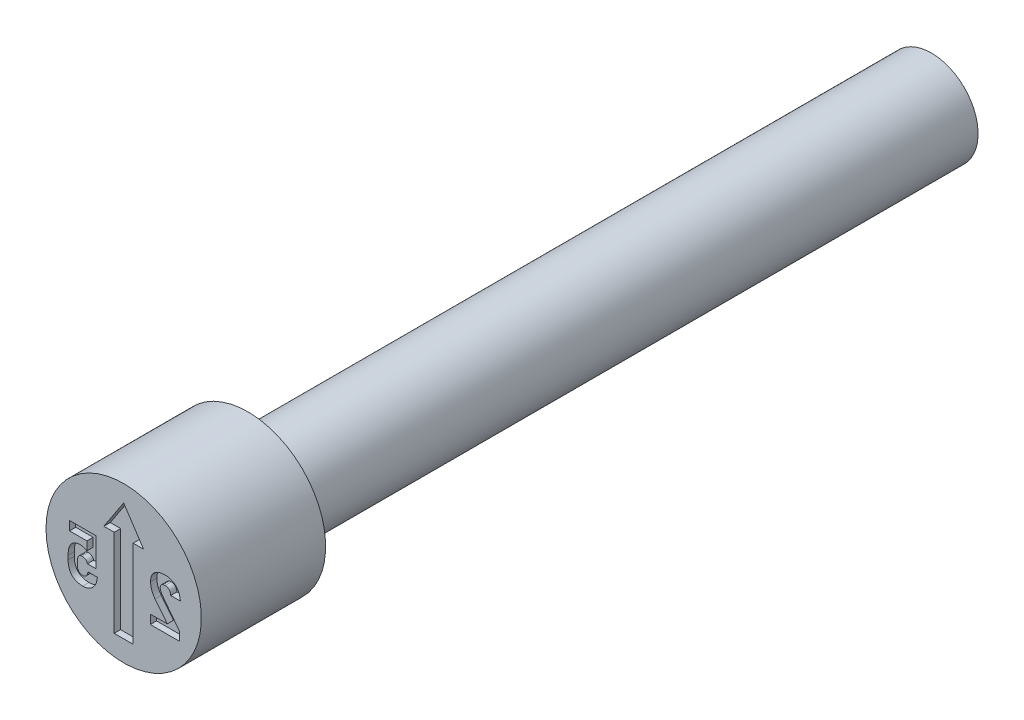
ISO-10303-21;
HEADER;
FILE_DESCRIPTION(('STEP AP214'),'2;1');
FILE_NAME('part.step','',(''),(''),'','','');
FILE_SCHEMA(('AUTOMOTIVE_DESIGN { 1 0 10303 214 1 1 1 1 }'));
ENDSEC;
DATA;
#1=APPLICATION_CONTEXT('core data for automotive mechanical design processes');
#2=APPLICATION_PROTOCOL_DEFINITION('international standard','automotive_design',2000,#1);
#3=PRODUCT_CONTEXT('',#1,'mechanical');
#4=PRODUCT('Part','Part','',(#3));
#5=PRODUCT_RELATED_PRODUCT_CATEGORY('part','',(#4));
#6=PRODUCT_DEFINITION_FORMATION('','',#4);
#7=PRODUCT_DEFINITION_CONTEXT('part definition',#1,'design');
#8=PRODUCT_DEFINITION('design','',#6,#7);
#9=PRODUCT_DEFINITION_SHAPE('','',#8);
#10=(LENGTH_UNIT() NAMED_UNIT(*) SI_UNIT(.MILLI.,.METRE.));
#11=(NAMED_UNIT(*) PLANE_ANGLE_UNIT() SI_UNIT($,.RADIAN.));
#12=(NAMED_UNIT(*) SI_UNIT($,.STERADIAN.) SOLID_ANGLE_UNIT());
#13=UNCERTAINTY_MEASURE_WITH_UNIT(LENGTH_MEASURE(1.E-05),#10,'distance_accuracy_value','');
#14=(GEOMETRIC_REPRESENTATION_CONTEXT(3) GLOBAL_UNCERTAINTY_ASSIGNED_CONTEXT((#13)) GLOBAL_UNIT_ASSIGNED_CONTEXT((#10,
#11,#12)) REPRESENTATION_CONTEXT('',''));
#15=CARTESIAN_POINT('',(0.,0.,0.));
#16=DIRECTION('',(0.,0.,1.));
#17=DIRECTION('',(1.,0.,0.));
#18=AXIS2_PLACEMENT_3D('',#15,#16,#17);
#19=CARTESIAN_POINT('',(-0.1524,0.495314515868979,-1.6556487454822));
#20=DIRECTION('',(-1.,0.,0.));
#21=DIRECTION('',(0.,-1.,0.));
#22=AXIS2_PLACEMENT_3D('',#19,#20,#21);
#23=PLANE('',#22);
#24=DIRECTION('',(0.,-1.,0.));
#25=VECTOR('',#24,1.);
#26=CARTESIAN_POINT('',(-0.1524,0.495314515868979,-0.10335957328));
#27=LINE('',#26,#25);
#28=CARTESIAN_POINT('',(-0.1524,0.495314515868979,-0.10335957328));
#29=VERTEX_POINT('',#28);
#30=CARTESIAN_POINT('',(-0.1524,-0.9144,-0.10335957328));
#31=VERTEX_POINT('',#30);
#32=EDGE_CURVE('E532',#29,#31,#27,.T.);
#33=ORIENTED_EDGE('',*,*,#32,.F.);
#34=DIRECTION('',(0.,0.,1.));
#35=VECTOR('',#34,1.);
#36=CARTESIAN_POINT('',(-0.1524,0.495314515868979,-0.10667978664));
#37=LINE('',#36,#35);
#38=CARTESIAN_POINT('',(-0.1524,0.495314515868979,0.));
#39=VERTEX_POINT('',#38);
#40=EDGE_CURVE('E541',#39,#29,#37,.F.);
#41=ORIENTED_EDGE('',*,*,#40,.F.);
#42=DIRECTION('',(0.,1.,0.));
#43=VECTOR('',#42,1.);
#44=CARTESIAN_POINT('',(-0.1524,0.,0.));
#45=LINE('',#44,#43);
#46=CARTESIAN_POINT('',(-0.1524,-0.9144,0.));
#47=VERTEX_POINT('',#46);
#48=EDGE_CURVE('E560',#47,#39,#45,.T.);
#49=ORIENTED_EDGE('',*,*,#48,.F.);
#50=DIRECTION('',(0.,0.,-1.));
#51=VECTOR('',#50,1.);
#52=CARTESIAN_POINT('',(-0.1524,-0.9144,-1.6556487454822));
#53=LINE('',#52,#51);
#54=EDGE_CURVE('E563',#47,#31,#53,.T.);
#55=ORIENTED_EDGE('',*,*,#54,.T.);
#56=EDGE_LOOP('',(#33,#41,#49,#55));
#57=FACE_BOUND('',#56,.T.);
#58=ADVANCED_FACE('F34',(#57),#23,.F.);
#59=CARTESIAN_POINT('',(2.096096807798E-13,0.495314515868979,-0.10667978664));
#60=DIRECTION('',(0.,1.,0.));
#61=DIRECTION('',(0.,0.,1.));
#62=AXIS2_PLACEMENT_3D('',#59,#60,#61);
#63=PLANE('',#62);
#64=ORIENTED_EDGE('',*,*,#40,.T.);
#65=DIRECTION('',(1.,0.,0.));
#66=VECTOR('',#65,1.);
#67=CARTESIAN_POINT('',(-0.31923088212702,0.495314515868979,-0.10335957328));
#68=LINE('',#67,#66);
#69=CARTESIAN_POINT('',(-0.319230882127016,0.495314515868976,-0.10335957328));
#70=VERTEX_POINT('',#69);
#71=EDGE_CURVE('E529',#70,#29,#68,.T.);
#72=ORIENTED_EDGE('',*,*,#71,.F.);
#73=DIRECTION('',(0.,0.,1.));
#74=VECTOR('',#73,1.);
#75=CARTESIAN_POINT('',(-0.319230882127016,0.495314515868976,-0.48767902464));
#76=LINE('',#75,#74);
#77=CARTESIAN_POINT('',(-0.31923088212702,0.495314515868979,0.));
#78=VERTEX_POINT('',#77);
#79=EDGE_CURVE('E575',#70,#78,#76,.T.);
#80=ORIENTED_EDGE('',*,*,#79,.T.);
#81=DIRECTION('',(1.,0.,0.));
#82=VECTOR('',#81,1.);
#83=CARTESIAN_POINT('',(0.62499875,0.495314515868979,0.));
#84=LINE('',#83,#82);
#85=EDGE_CURVE('E557',#39,#78,#84,.F.);
#86=ORIENTED_EDGE('',*,*,#85,.F.);
#87=EDGE_LOOP('',(#64,#72,#80,#86));
#88=FACE_BOUND('',#87,.T.);
#89=ADVANCED_FACE('F610',(#88),#63,.T.);
#90=CARTESIAN_POINT('',(-0.54143825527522,0.158036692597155,-0.48767902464));
#91=DIRECTION('',(-0.835059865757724,0.550159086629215,0.));
#92=DIRECTION('',(-0.550159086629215,-0.835059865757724,0.));
#93=AXIS2_PLACEMENT_3D('',#90,#91,#92);
#94=PLANE('',#93);
#95=DIRECTION('',(-0.550159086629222,-0.835059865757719,0.));
#96=VECTOR('',#95,1.);
#97=CARTESIAN_POINT('',(0.,0.979859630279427,-0.10335957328));
#98=LINE('',#97,#96);
#99=CARTESIAN_POINT('',(0.,0.979859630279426,-0.10335957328));
#100=VERTEX_POINT('',#99);
#101=EDGE_CURVE('E526',#100,#70,#98,.T.);
#102=ORIENTED_EDGE('',*,*,#101,.F.);
#103=DIRECTION('',(0.,0.,1.));
#104=VECTOR('',#103,1.);
#105=CARTESIAN_POINT('',(0.,0.979859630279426,-0.48767902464));
#106=LINE('',#105,#104);
#107=CARTESIAN_POINT('',(0.,0.979859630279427,0.));
#108=VERTEX_POINT('',#107);
#109=EDGE_CURVE('E573',#100,#108,#106,.T.);
#110=ORIENTED_EDGE('',*,*,#109,.T.);
#111=DIRECTION('',(0.550159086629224,0.835059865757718,0.));
#112=VECTOR('',#111,1.);
#113=CARTESIAN_POINT('',(-0.319230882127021,0.495314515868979,0.));
#114=LINE('',#113,#112);
#115=EDGE_CURVE('E554',#78,#108,#114,.T.);
#116=ORIENTED_EDGE('',*,*,#115,.F.);
#117=ORIENTED_EDGE('',*,*,#79,.F.);
#118=EDGE_LOOP('',(#102,#110,#116,#117));
#119=FACE_BOUND('',#118,.T.);
#120=ADVANCED_FACE('F614',(#119),#94,.F.);
#121=CARTESIAN_POINT('',(0.,0.979859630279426,-0.48767902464));
#122=DIRECTION('',(0.835059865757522,0.550159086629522,0.));
#123=DIRECTION('',(-0.550159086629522,0.835059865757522,0.));
#124=AXIS2_PLACEMENT_3D('',#121,#122,#123);
#125=PLANE('',#124);
#126=DIRECTION('',(-0.550159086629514,0.835059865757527,0.));
#127=VECTOR('',#126,1.);
#128=CARTESIAN_POINT('',(0.319230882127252,0.495314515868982,-0.10335957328));
#129=LINE('',#128,#127);
#130=CARTESIAN_POINT('',(0.319230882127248,0.495314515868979,-0.10335957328));
#131=VERTEX_POINT('',#130);
#132=EDGE_CURVE('E523',#131,#100,#129,.T.);
#133=ORIENTED_EDGE('',*,*,#132,.F.);
#134=DIRECTION('',(0.,0.,1.));
#135=VECTOR('',#134,1.);
#136=CARTESIAN_POINT('',(0.319230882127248,0.495314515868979,-0.10667978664));
#137=LINE('',#136,#135);
#138=CARTESIAN_POINT('',(0.319230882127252,0.495314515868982,0.));
#139=VERTEX_POINT('',#138);
#140=EDGE_CURVE('E570',#139,#131,#137,.F.);
#141=ORIENTED_EDGE('',*,*,#140,.F.);
#142=DIRECTION('',(0.550159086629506,-0.835059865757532,0.));
#143=VECTOR('',#142,1.);
#144=CARTESIAN_POINT('',(0.,0.979859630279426,0.));
#145=LINE('',#144,#143);
#146=EDGE_CURVE('E551',#108,#139,#145,.T.);
#147=ORIENTED_EDGE('',*,*,#146,.F.);
#148=ORIENTED_EDGE('',*,*,#109,.F.);
#149=EDGE_LOOP('',(#133,#141,#147,#148));
#150=FACE_BOUND('',#149,.T.);
#151=ADVANCED_FACE('F618',(#150),#125,.F.);
#152=CARTESIAN_POINT('',(2.096096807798E-13,0.495314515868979,-0.10667978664));
#153=DIRECTION('',(0.,1.,0.));
#154=DIRECTION('',(0.,0.,1.));
#155=AXIS2_PLACEMENT_3D('',#152,#153,#154);
#156=PLANE('',#155);
#157=ORIENTED_EDGE('',*,*,#140,.T.);
#158=DIRECTION('',(1.,0.,0.));
#159=VECTOR('',#158,1.);
#160=CARTESIAN_POINT('',(0.1524,0.495314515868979,-0.10335957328));
#161=LINE('',#160,#159);
#162=CARTESIAN_POINT('',(0.1524,0.495314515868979,-0.10335957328));
#163=VERTEX_POINT('',#162);
#164=EDGE_CURVE('E489',#163,#131,#161,.T.);
#165=ORIENTED_EDGE('',*,*,#164,.F.);
#166=DIRECTION('',(0.,0.,1.));
#167=VECTOR('',#166,1.);
#168=CARTESIAN_POINT('',(0.1524,0.495314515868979,-1.6556487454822));
#169=LINE('',#168,#167);
#170=CARTESIAN_POINT('',(0.1524,0.495314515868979,0.));
#171=VERTEX_POINT('',#170);
#172=EDGE_CURVE('E568',#163,#171,#169,.T.);
#173=ORIENTED_EDGE('',*,*,#172,.T.);
#174=DIRECTION('',(1.,0.,0.));
#175=VECTOR('',#174,1.);
#176=CARTESIAN_POINT('',(0.62499875,0.495314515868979,0.));
#177=LINE('',#176,#175);
#178=EDGE_CURVE('E548',#139,#171,#177,.F.);
#179=ORIENTED_EDGE('',*,*,#178,.F.);
#180=EDGE_LOOP('',(#157,#165,#173,#179));
#181=FACE_BOUND('',#180,.T.);
#182=ADVANCED_FACE('F620',(#181),#156,.T.);
#183=CARTESIAN_POINT('',(0.1524,0.495314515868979,-1.6556487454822));
#184=DIRECTION('',(1.,0.,0.));
#185=DIRECTION('',(0.,1.,0.));
#186=AXIS2_PLACEMENT_3D('',#183,#184,#185);
#187=PLANE('',#186);
#188=DIRECTION('',(0.,1.,0.));
#189=VECTOR('',#188,1.);
#190=CARTESIAN_POINT('',(0.1524,-0.9144,-0.10335957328));
#191=LINE('',#190,#189);
#192=CARTESIAN_POINT('',(0.1524,-0.9144,-0.10335957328));
#193=VERTEX_POINT('',#192);
#194=EDGE_CURVE('E538',#193,#163,#191,.T.);
#195=ORIENTED_EDGE('',*,*,#194,.F.);
#196=DIRECTION('',(0.,0.,-1.));
#197=VECTOR('',#196,1.);
#198=CARTESIAN_POINT('',(0.1524,-0.9144,-1.6556487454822));
#199=LINE('',#198,#197);
#200=CARTESIAN_POINT('',(0.1524,-0.9144,0.));
#201=VERTEX_POINT('',#200);
#202=EDGE_CURVE('E566',#193,#201,#199,.F.);
#203=ORIENTED_EDGE('',*,*,#202,.T.);
#204=DIRECTION('',(0.,1.,0.));
#205=VECTOR('',#204,1.);
#206=CARTESIAN_POINT('',(0.1524,0.,0.));
#207=LINE('',#206,#205);
#208=EDGE_CURVE('E545',#171,#201,#207,.F.);
#209=ORIENTED_EDGE('',*,*,#208,.F.);
#210=ORIENTED_EDGE('',*,*,#172,.F.);
#211=EDGE_LOOP('',(#195,#203,#209,#210));
#212=FACE_BOUND('',#211,.T.);
#213=ADVANCED_FACE('F603',(#212),#187,.F.);
#214=CARTESIAN_POINT('',(-0.1524,-0.9144,-1.6556487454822));
#215=DIRECTION('',(0.,-1.,0.));
#216=DIRECTION('',(0.,0.,-1.));
#217=AXIS2_PLACEMENT_3D('',#214,#215,#216);
#218=PLANE('',#217);
#219=DIRECTION('',(1.,0.,0.));
#220=VECTOR('',#219,1.);
#221=CARTESIAN_POINT('',(-0.1524,-0.9144,-0.10335957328));
#222=LINE('',#221,#220);
#223=EDGE_CURVE('E535',#31,#193,#222,.T.);
#224=ORIENTED_EDGE('',*,*,#223,.F.);
#225=ORIENTED_EDGE('',*,*,#54,.F.);
#226=DIRECTION('',(1.,0.,0.));
#227=VECTOR('',#226,1.);
#228=CARTESIAN_POINT('',(0.62499875,-0.9144,0.));
#229=LINE('',#228,#227);
#230=EDGE_CURVE('E542',#201,#47,#229,.F.);
#231=ORIENTED_EDGE('',*,*,#230,.F.);
#232=ORIENTED_EDGE('',*,*,#202,.F.);
#233=EDGE_LOOP('',(#224,#225,#231,#232));
#234=FACE_BOUND('',#233,.T.);
#235=ADVANCED_FACE('F593',(#234),#218,.F.);
#236=CARTESIAN_POINT('',(0.62499875,0.,0.));
#237=DIRECTION('',(0.,0.,1.));
#238=DIRECTION('',(1.,0.,0.));
#239=AXIS2_PLACEMENT_3D('',#236,#237,#238);
#240=PLANE('',#239);
#241=CARTESIAN_POINT('',(-0.894711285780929,-0.262787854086,0.));
#242=CARTESIAN_POINT('',(-0.894354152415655,-0.275247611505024,0.));
#243=CARTESIAN_POINT('',(-0.893663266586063,-0.299351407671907,0.));
#244=CARTESIAN_POINT('',(-0.888722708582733,-0.334207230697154,0.));
#245=CARTESIAN_POINT('',(-0.879816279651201,-0.366180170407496,0.));
#246=CARTESIAN_POINT('',(-0.867882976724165,-0.395476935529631,0.));
#247=CARTESIAN_POINT('',(-0.85230057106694,-0.421515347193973,0.));
#248=CARTESIAN_POINT('',(-0.833641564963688,-0.444515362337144,0.));
#249=CARTESIAN_POINT('',(-0.811565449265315,-0.463945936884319,0.));
#250=CARTESIAN_POINT('',(-0.78659323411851,-0.480298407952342,0.));
#251=CARTESIAN_POINT('',(-0.75848730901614,-0.492839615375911,0.));
#252=CARTESIAN_POINT('',(-0.727696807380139,-0.501950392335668,0.));
#253=CARTESIAN_POINT('',(-0.694099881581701,-0.507369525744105,0.));
#254=CARTESIAN_POINT('',(-0.670833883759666,-0.507992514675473,0.));
#255=CARTESIAN_POINT('',(-0.658803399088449,-0.508314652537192,0.));
#256=B_SPLINE_CURVE_WITH_KNOTS('',3,(#241,#242,#243,#244,#245,#246,#247,#248,#249,#250,#251,
#252,#253,#254,#255),.UNSPECIFIED.,.F.,.F.,(4,1,1,1,1,1,1,1,1,1,1,1,4),(0.,0.096591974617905,
0.1868602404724,0.272108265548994,0.35332451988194,0.431359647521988,0.506505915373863,
0.582010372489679,0.6584354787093,0.737063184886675,0.819709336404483,0.906774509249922,1.),.UNSPECIFIED.);
#257=CARTESIAN_POINT('',(-0.894711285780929,-0.262787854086,0.));
#258=VERTEX_POINT('',#257);
#259=CARTESIAN_POINT('',(-0.658803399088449,-0.508314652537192,0.));
#260=VERTEX_POINT('',#259);
#261=EDGE_CURVE('E50',#258,#260,#256,.T.);
#262=ORIENTED_EDGE('',*,*,#261,.F.);
#263=DIRECTION('',(0.,-1.,0.));
#264=VECTOR('',#263,1.);
#265=CARTESIAN_POINT('',(-0.894711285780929,-0.195781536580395,0.));
#266=LINE('',#265,#264);
#267=CARTESIAN_POINT('',(-0.894711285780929,-0.195781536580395,0.));
#268=VERTEX_POINT('',#267);
#269=EDGE_CURVE('E331',#268,#258,#266,.T.);
#270=ORIENTED_EDGE('',*,*,#269,.F.);
#271=CARTESIAN_POINT('',(-0.697768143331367,0.0490931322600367,0.));
#272=CARTESIAN_POINT('',(-0.707794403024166,0.048775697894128,0.));
#273=CARTESIAN_POINT('',(-0.727240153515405,0.0481600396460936,0.));
#274=CARTESIAN_POINT('',(-0.755289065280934,0.0426220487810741,0.));
#275=CARTESIAN_POINT('',(-0.781138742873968,0.0337496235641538,0.));
#276=CARTESIAN_POINT('',(-0.804575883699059,0.0209670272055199,0.));
#277=CARTESIAN_POINT('',(-0.825626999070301,0.00494597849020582,0.));
#278=CARTESIAN_POINT('',(-0.843911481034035,-0.0146304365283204,0.));
#279=CARTESIAN_POINT('',(-0.859543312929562,-0.0374431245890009,0.));
#280=CARTESIAN_POINT('',(-0.872336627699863,-0.0635073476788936,0.));
#281=CARTESIAN_POINT('',(-0.882405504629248,-0.0925947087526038,0.));
#282=CARTESIAN_POINT('',(-0.889718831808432,-0.124502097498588,0.));
#283=CARTESIAN_POINT('',(-0.893886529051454,-0.159260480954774,0.));
#284=CARTESIAN_POINT('',(-0.894429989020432,-0.183325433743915,0.));
#285=CARTESIAN_POINT('',(-0.894711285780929,-0.195781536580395,0.));
#286=B_SPLINE_CURVE_WITH_KNOTS('',3,(#271,#272,#273,#274,#275,#276,#277,#278,#279,#280,#281,
#282,#283,#284,#285),.UNSPECIFIED.,.F.,.F.,(4,1,1,1,1,1,1,1,1,1,1,1,4),(0.,0.084394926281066,
0.163682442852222,0.239848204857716,0.313806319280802,0.3876154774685,0.461788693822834,
0.538496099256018,0.61978489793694,0.70565234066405,0.797279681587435,0.895071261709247,1.),.UNSPECIFIED.);
#287=CARTESIAN_POINT('',(-0.697768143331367,0.0490931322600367,0.));
#288=VERTEX_POINT('',#287);
#289=EDGE_CURVE('E334',#288,#268,#286,.T.);
#290=ORIENTED_EDGE('',*,*,#289,.F.);
#291=CARTESIAN_POINT('',(-0.592775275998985,0.0133890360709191,0.));
#292=CARTESIAN_POINT('',(-0.595810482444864,0.0160766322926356,0.));
#293=CARTESIAN_POINT('',(-0.602054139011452,0.0216052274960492,0.));
#294=CARTESIAN_POINT('',(-0.612969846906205,0.0286250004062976,0.));
#295=CARTESIAN_POINT('',(-0.62545406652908,0.0345871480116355,0.));
#296=CARTESIAN_POINT('',(-0.643875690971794,0.0414539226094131,0.));
#297=CARTESIAN_POINT('',(-0.668108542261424,0.0475601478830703,0.));
#298=CARTESIAN_POINT('',(-0.688002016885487,0.0485883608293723,0.));
#299=CARTESIAN_POINT('',(-0.697768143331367,0.0490931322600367,0.));
#300=B_SPLINE_CURVE_WITH_KNOTS('',3,(#291,#292,#293,#294,#295,#296,#297,#298,#299),
.UNSPECIFIED.,.F.,.F.,(4,1,1,1,1,1,4),(0.,0.107291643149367,0.220707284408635,0.342410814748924,
0.47317918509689,0.741372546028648,1.),.UNSPECIFIED.);
#301=CARTESIAN_POINT('',(-0.592775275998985,0.0133890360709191,0.));
#302=VERTEX_POINT('',#301);
#303=EDGE_CURVE('E1120',#302,#288,#300,.T.);
#304=ORIENTED_EDGE('',*,*,#303,.F.);
#305=DIRECTION('',(0.,-1.,0.));
#306=VECTOR('',#305,1.);
#307=CARTESIAN_POINT('',(-0.592775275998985,0.154738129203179,0.));
#308=LINE('',#307,#306);
#309=CARTESIAN_POINT('',(-0.592775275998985,0.154738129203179,0.));
#310=VERTEX_POINT('',#309);
#311=EDGE_CURVE('E1117',#310,#302,#308,.T.);
#312=ORIENTED_EDGE('',*,*,#311,.F.);
#313=DIRECTION('',(1.,0.,0.));
#314=VECTOR('',#313,1.);
#315=CARTESIAN_POINT('',(-0.871723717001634,0.154738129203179,0.));
#316=LINE('',#315,#314);
#317=CARTESIAN_POINT('',(-0.871723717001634,0.154738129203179,0.));
#318=VERTEX_POINT('',#317);
#319=EDGE_CURVE('E1114',#318,#310,#316,.T.);
#320=ORIENTED_EDGE('',*,*,#319,.F.);
#321=DIRECTION('',(0.,-1.,0.));
#322=VECTOR('',#321,1.);
#323=CARTESIAN_POINT('',(-0.871723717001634,0.3,0.));
#324=LINE('',#323,#322);
#325=CARTESIAN_POINT('',(-0.871723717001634,0.3,0.));
#326=VERTEX_POINT('',#325);
#327=EDGE_CURVE('E1111',#326,#318,#324,.T.);
#328=ORIENTED_EDGE('',*,*,#327,.F.);
#329=DIRECTION('',(-1.,0.,0.));
#330=VECTOR('',#329,1.);
#331=CARTESIAN_POINT('',(-0.441970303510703,0.3,0.));
#332=LINE('',#331,#330);
#333=CARTESIAN_POINT('',(-0.441970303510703,0.3,0.));
#334=VERTEX_POINT('',#333);
#335=EDGE_CURVE('E1108',#334,#326,#332,.T.);
#336=ORIENTED_EDGE('',*,*,#335,.F.);
#337=DIRECTION('',(0.,1.,0.));
#338=VECTOR('',#337,1.);
#339=CARTESIAN_POINT('',(-0.441970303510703,-0.159914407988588,0.));
#340=LINE('',#339,#338);
#341=CARTESIAN_POINT('',(-0.441970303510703,-0.159914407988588,0.));
#342=VERTEX_POINT('',#341);
#343=EDGE_CURVE('E1105',#342,#334,#340,.T.);
#344=ORIENTED_EDGE('',*,*,#343,.F.);
#345=DIRECTION('',(1.,0.,0.));
#346=VECTOR('',#345,1.);
#347=CARTESIAN_POINT('',(-0.582830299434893,-0.159914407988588,0.));
#348=LINE('',#347,#346);
#349=CARTESIAN_POINT('',(-0.582830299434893,-0.159914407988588,0.));
#350=VERTEX_POINT('',#349);
#351=EDGE_CURVE('E1099',#350,#342,#348,.T.);
#352=ORIENTED_EDGE('',*,*,#351,.F.);
#353=CARTESIAN_POINT('',(-0.669726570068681,-0.0971469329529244,0.));
#354=CARTESIAN_POINT('',(-0.664492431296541,-0.0973065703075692,0.));
#355=CARTESIAN_POINT('',(-0.654359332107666,-0.0976156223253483,0.));
#356=CARTESIAN_POINT('',(-0.639769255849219,-0.10081569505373,0.));
#357=CARTESIAN_POINT('',(-0.626359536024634,-0.106051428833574,0.));
#358=CARTESIAN_POINT('',(-0.614282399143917,-0.113453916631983,0.));
#359=CARTESIAN_POINT('',(-0.603615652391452,-0.122526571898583,0.));
#360=CARTESIAN_POINT('',(-0.594833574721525,-0.133489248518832,0.));
#361=CARTESIAN_POINT('',(-0.587471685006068,-0.145876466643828,0.));
#362=CARTESIAN_POINT('',(-0.584399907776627,-0.155167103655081,0.));
#363=CARTESIAN_POINT('',(-0.582830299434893,-0.159914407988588,0.));
#364=B_SPLINE_CURVE_WITH_KNOTS('',3,(#353,#354,#355,#356,#357,#358,#359,#360,#361,#362,#363),
.UNSPECIFIED.,.F.,.F.,(4,1,1,1,1,1,1,1,4),(0.,0.135635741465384,0.262585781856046,
0.385395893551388,0.507524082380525,0.628507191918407,0.746772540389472,0.870606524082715,1.),.UNSPECIFIED.);
#365=CARTESIAN_POINT('',(-0.669726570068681,-0.0971469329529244,0.));
#366=VERTEX_POINT('',#365);
#367=EDGE_CURVE('E1091',#366,#350,#364,.T.);
#368=ORIENTED_EDGE('',*,*,#367,.F.);
#369=CARTESIAN_POINT('',(-0.744069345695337,-0.195781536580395,0.));
#370=CARTESIAN_POINT('',(-0.743908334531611,-0.188316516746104,0.));
#371=CARTESIAN_POINT('',(-0.743602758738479,-0.174148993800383,0.));
#372=CARTESIAN_POINT('',(-0.739801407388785,-0.154330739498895,0.));
#373=CARTESIAN_POINT('',(-0.733891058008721,-0.137039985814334,0.));
#374=CARTESIAN_POINT('',(-0.7251622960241,-0.122686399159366,0.));
#375=CARTESIAN_POINT('',(-0.714311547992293,-0.111100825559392,0.));
#376=CARTESIAN_POINT('',(-0.701180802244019,-0.102872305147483,0.));
#377=CARTESIAN_POINT('',(-0.686033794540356,-0.0980124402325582,0.));
#378=CARTESIAN_POINT('',(-0.67530625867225,-0.0974430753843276,0.));
#379=CARTESIAN_POINT('',(-0.669726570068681,-0.0971469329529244,0.));
#380=B_SPLINE_CURVE_WITH_KNOTS('',3,(#369,#370,#371,#372,#373,#374,#375,#376,#377,#378,#379),
.UNSPECIFIED.,.F.,.F.,(4,1,1,1,1,1,1,1,4),(0.,0.160198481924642,0.304033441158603,
0.431843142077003,0.550810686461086,0.662316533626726,0.76988812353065,0.880312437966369,1.),.UNSPECIFIED.);
#381=CARTESIAN_POINT('',(-0.744069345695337,-0.195781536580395,0.));
#382=VERTEX_POINT('',#381);
#383=EDGE_CURVE('E1086',#382,#366,#380,.T.);
#384=ORIENTED_EDGE('',*,*,#383,.F.);
#385=DIRECTION('',(0.,1.,0.));
#386=VECTOR('',#385,1.);
#387=CARTESIAN_POINT('',(-0.744069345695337,-0.262787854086,0.));
#388=LINE('',#387,#386);
#389=CARTESIAN_POINT('',(-0.744069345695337,-0.262787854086,0.));
#390=VERTEX_POINT('',#389);
#391=EDGE_CURVE('E1080',#390,#382,#388,.T.);
#392=ORIENTED_EDGE('',*,*,#391,.F.);
#393=CARTESIAN_POINT('',(-0.660922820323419,-0.361911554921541,0.));
#394=CARTESIAN_POINT('',(-0.667210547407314,-0.361637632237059,0.));
#395=CARTESIAN_POINT('',(-0.679237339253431,-0.361113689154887,0.));
#396=CARTESIAN_POINT('',(-0.696094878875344,-0.356056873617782,0.));
#397=CARTESIAN_POINT('',(-0.710770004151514,-0.347960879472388,0.));
#398=CARTESIAN_POINT('',(-0.722891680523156,-0.33631115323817,0.));
#399=CARTESIAN_POINT('',(-0.732561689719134,-0.321795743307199,0.));
#400=CARTESIAN_POINT('',(-0.739406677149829,-0.304413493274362,0.));
#401=CARTESIAN_POINT('',(-0.743460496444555,-0.284440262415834,0.));
#402=CARTESIAN_POINT('',(-0.743859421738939,-0.270253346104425,0.));
#403=CARTESIAN_POINT('',(-0.744069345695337,-0.262787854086,0.));
#404=B_SPLINE_CURVE_WITH_KNOTS('',3,(#393,#394,#395,#396,#397,#398,#399,#400,#401,#402,#403),
.UNSPECIFIED.,.F.,.F.,(4,1,1,1,1,1,1,1,4),(0.,0.128261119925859,0.245330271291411,
0.356275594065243,0.467886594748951,0.585607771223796,0.710231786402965,0.847517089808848,1.),.UNSPECIFIED.);
#405=CARTESIAN_POINT('',(-0.660922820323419,-0.361911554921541,0.));
#406=VERTEX_POINT('',#405);
#407=EDGE_CURVE('E1072',#406,#390,#404,.T.);
#408=ORIENTED_EDGE('',*,*,#407,.F.);
#409=CARTESIAN_POINT('',(-0.575167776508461,-0.268820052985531,0.));
#410=CARTESIAN_POINT('',(-0.576028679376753,-0.275822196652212,0.));
#411=CARTESIAN_POINT('',(-0.57766933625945,-0.289166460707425,0.));
#412=CARTESIAN_POINT('',(-0.583585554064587,-0.307684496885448,0.));
#413=CARTESIAN_POINT('',(-0.591309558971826,-0.323961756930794,0.));
#414=CARTESIAN_POINT('',(-0.601512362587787,-0.337619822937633,0.));
#415=CARTESIAN_POINT('',(-0.613628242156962,-0.348708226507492,0.));
#416=CARTESIAN_POINT('',(-0.62798515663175,-0.356228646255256,0.));
#417=CARTESIAN_POINT('',(-0.643852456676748,-0.361246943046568,0.));
#418=CARTESIAN_POINT('',(-0.655121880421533,-0.361685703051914,0.));
#419=CARTESIAN_POINT('',(-0.660922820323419,-0.361911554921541,0.));
#420=B_SPLINE_CURVE_WITH_KNOTS('',3,(#409,#410,#411,#412,#413,#414,#415,#416,#417,#418,#419),
.UNSPECIFIED.,.F.,.F.,(4,1,1,1,1,1,1,1,4),(0.,0.150277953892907,0.286390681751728,
0.412971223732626,0.533144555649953,0.648163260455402,0.760273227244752,0.876600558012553,1.),.UNSPECIFIED.);
#421=CARTESIAN_POINT('',(-0.575167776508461,-0.268820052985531,0.));
#422=VERTEX_POINT('',#421);
#423=EDGE_CURVE('E1067',#422,#406,#420,.T.);
#424=ORIENTED_EDGE('',*,*,#423,.F.);
#425=DIRECTION('',(0.,-1.,0.));
#426=VECTOR('',#425,1.);
#427=CARTESIAN_POINT('',(-0.575167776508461,-0.268330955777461,0.));
#428=LINE('',#427,#426);
#429=CARTESIAN_POINT('',(-0.575167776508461,-0.268330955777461,0.));
#430=VERTEX_POINT('',#429);
#431=EDGE_CURVE('E1064',#430,#422,#428,.T.);
#432=ORIENTED_EDGE('',*,*,#431,.F.);
#433=DIRECTION('',(-1.,0.,0.));
#434=VECTOR('',#433,1.);
#435=CARTESIAN_POINT('',(-0.424362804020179,-0.268330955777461,0.));
#436=LINE('',#435,#434);
#437=CARTESIAN_POINT('',(-0.424362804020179,-0.268330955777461,0.));
#438=VERTEX_POINT('',#437);
#439=EDGE_CURVE('E1061',#438,#430,#436,.T.);
#440=ORIENTED_EDGE('',*,*,#439,.F.);
#441=DIRECTION('',(0.,1.,0.));
#442=VECTOR('',#441,1.);
#443=CARTESIAN_POINT('',(-0.424362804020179,-0.268820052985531,0.));
#444=LINE('',#443,#442);
#445=CARTESIAN_POINT('',(-0.424362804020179,-0.268820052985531,0.));
#446=VERTEX_POINT('',#445);
#447=EDGE_CURVE('E1055',#446,#438,#444,.T.);
#448=ORIENTED_EDGE('',*,*,#447,.F.);
#449=CARTESIAN_POINT('',(-0.658803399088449,-0.508314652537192,0.));
#450=CARTESIAN_POINT('',(-0.648289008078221,-0.507993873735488,0.));
#451=CARTESIAN_POINT('',(-0.627714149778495,-0.507366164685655,0.));
#452=CARTESIAN_POINT('',(-0.597723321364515,-0.501731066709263,0.));
#453=CARTESIAN_POINT('',(-0.569291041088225,-0.493004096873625,0.));
#454=CARTESIAN_POINT('',(-0.542628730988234,-0.48055447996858,0.));
#455=CARTESIAN_POINT('',(-0.518026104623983,-0.464737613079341,0.));
#456=CARTESIAN_POINT('',(-0.496027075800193,-0.445396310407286,0.));
#457=CARTESIAN_POINT('',(-0.476429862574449,-0.423036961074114,0.));
#458=CARTESIAN_POINT('',(-0.459627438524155,-0.397463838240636,0.));
#459=CARTESIAN_POINT('',(-0.445789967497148,-0.368950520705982,0.));
#460=CARTESIAN_POINT('',(-0.435017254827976,-0.337833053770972,0.));
#461=CARTESIAN_POINT('',(-0.427618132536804,-0.304167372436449,0.));
#462=CARTESIAN_POINT('',(-0.425467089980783,-0.280810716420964,0.));
#463=CARTESIAN_POINT('',(-0.424362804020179,-0.268820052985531,0.));
#464=B_SPLINE_CURVE_WITH_KNOTS('',3,(#449,#450,#451,#452,#453,#454,#455,#456,#457,#458,#459,
#460,#461,#462,#463),.UNSPECIFIED.,.F.,.F.,(4,1,1,1,1,1,1,1,1,1,1,1,4),(0.,0.0844304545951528,
0.165215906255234,0.244369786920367,0.322918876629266,0.40093676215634,0.478631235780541,
0.557558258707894,0.639203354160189,0.723781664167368,0.811629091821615,0.903295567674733,1.),.UNSPECIFIED.);
#465=EDGE_CURVE('E1048',#260,#446,#464,.T.);
#466=ORIENTED_EDGE('',*,*,#465,.F.);
#467=EDGE_LOOP('',(#262,#270,#290,#304,#312,#320,#328,#336,#344,#352,#368,#384,#392,#408,#424,
#432,#440,#448,#466));
#468=FACE_BOUND('',#467,.T.);
#469=DIRECTION('',(0.,1.,0.));
#470=VECTOR('',#469,1.);
#471=CARTESIAN_POINT('',(0.90156016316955,-0.5,0.));
#472=LINE('',#471,#470);
#473=CARTESIAN_POINT('',(0.90156016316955,-0.5,0.));
#474=VERTEX_POINT('',#473);
#475=CARTESIAN_POINT('',(0.90156016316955,-0.364030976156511,0.));
#476=VERTEX_POINT('',#475);
#477=EDGE_CURVE('E58',#474,#476,#472,.T.);
#478=ORIENTED_EDGE('',*,*,#477,.F.);
#479=DIRECTION('',(1.,0.,0.));
#480=VECTOR('',#479,1.);
#481=CARTESIAN_POINT('',(0.428440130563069,-0.5,0.));
#482=LINE('',#481,#480);
#483=CARTESIAN_POINT('',(0.428440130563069,-0.5,0.));
#484=VERTEX_POINT('',#483);
#485=EDGE_CURVE('E483',#484,#474,#482,.T.);
#486=ORIENTED_EDGE('',*,*,#485,.F.);
#487=DIRECTION('',(0.,-1.,0.));
#488=VECTOR('',#487,1.);
#489=CARTESIAN_POINT('',(0.428440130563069,-0.354738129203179,0.));
#490=LINE('',#489,#488);
#491=CARTESIAN_POINT('',(0.428440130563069,-0.354738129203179,0.));
#492=VERTEX_POINT('',#491);
#493=EDGE_CURVE('E480',#492,#484,#490,.T.);
#494=ORIENTED_EDGE('',*,*,#493,.F.);
#495=DIRECTION('',(-1.,0.,0.));
#496=VECTOR('',#495,1.);
#497=CARTESIAN_POINT('',(0.701845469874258,-0.354738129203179,0.));
#498=LINE('',#497,#496);
#499=CARTESIAN_POINT('',(0.701845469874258,-0.354738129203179,0.));
#500=VERTEX_POINT('',#499);
#501=EDGE_CURVE('E477',#500,#492,#498,.T.);
#502=ORIENTED_EDGE('',*,*,#501,.F.);
#503=DIRECTION('',(0.620676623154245,-0.78406666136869,0.));
#504=VECTOR('',#503,1.);
#505=CARTESIAN_POINT('',(0.504902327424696,-0.105950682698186,0.));
#506=LINE('',#505,#504);
#507=CARTESIAN_POINT('',(0.504902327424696,-0.105950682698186,0.));
#508=VERTEX_POINT('',#507);
#509=EDGE_CURVE('E471',#508,#500,#506,.T.);
#510=ORIENTED_EDGE('',*,*,#509,.F.);
#511=CARTESIAN_POINT('',(0.4328420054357,0.0991440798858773,0.));
#512=CARTESIAN_POINT('',(0.433051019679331,0.0900571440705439,0.));
#513=CARTESIAN_POINT('',(0.433469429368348,0.0718666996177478,0.));
#514=CARTESIAN_POINT('',(0.437201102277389,0.0446907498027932,0.));
#515=CARTESIAN_POINT('',(0.44330294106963,0.0176718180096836,0.));
#516=CARTESIAN_POINT('',(0.45158231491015,-0.0090954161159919,0.));
#517=CARTESIAN_POINT('',(0.461920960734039,-0.0351639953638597,0.));
#518=CARTESIAN_POINT('',(0.474259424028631,-0.0601185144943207,0.));
#519=CARTESIAN_POINT('',(0.488346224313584,-0.0838952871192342,0.));
#520=CARTESIAN_POINT('',(0.499384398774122,-0.098599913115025,0.));
#521=CARTESIAN_POINT('',(0.504902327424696,-0.105950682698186,0.));
#522=B_SPLINE_CURVE_WITH_KNOTS('',3,(#511,#512,#513,#514,#515,#516,#517,#518,#519,#520,#521),
.UNSPECIFIED.,.F.,.F.,(4,1,1,1,1,1,1,1,4),(0.,0.123148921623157,0.246522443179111,
0.371108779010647,0.498350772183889,0.625999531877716,0.750879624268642,0.875465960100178,1.),.UNSPECIFIED.);
#523=CARTESIAN_POINT('',(0.4328420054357,0.0991440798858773,0.));
#524=VERTEX_POINT('',#523);
#525=EDGE_CURVE('E466',#524,#508,#522,.T.);
#526=ORIENTED_EDGE('',*,*,#525,.F.);
#527=DIRECTION('',(0.,-1.,0.));
#528=VECTOR('',#527,1.);
#529=CARTESIAN_POINT('',(0.4328420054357,0.0997962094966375,0.));
#530=LINE('',#529,#528);
#531=CARTESIAN_POINT('',(0.4328420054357,0.0997962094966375,0.));
#532=VERTEX_POINT('',#531);
#533=EDGE_CURVE('E460',#532,#524,#530,.T.);
#534=ORIENTED_EDGE('',*,*,#533,.F.);
#535=CARTESIAN_POINT('',(0.669402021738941,0.308314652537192,0.));
#536=CARTESIAN_POINT('',(0.657377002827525,0.308063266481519,0.));
#537=CARTESIAN_POINT('',(0.634103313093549,0.307576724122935,0.));
#538=CARTESIAN_POINT('',(0.600590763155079,0.302996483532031,0.));
#539=CARTESIAN_POINT('',(0.569775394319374,0.295374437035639,0.));
#540=CARTESIAN_POINT('',(0.541734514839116,0.284665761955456,0.));
#541=CARTESIAN_POINT('',(0.51665225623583,0.270900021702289,0.));
#542=CARTESIAN_POINT('',(0.494412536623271,0.254560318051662,0.));
#543=CARTESIAN_POINT('',(0.47564328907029,0.235012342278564,0.));
#544=CARTESIAN_POINT('',(0.460030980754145,0.212805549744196,0.));
#545=CARTESIAN_POINT('',(0.447723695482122,0.188025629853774,0.));
#546=CARTESIAN_POINT('',(0.439104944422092,0.160693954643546,0.));
#547=CARTESIAN_POINT('',(0.433826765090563,0.13103006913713,0.));
#548=CARTESIAN_POINT('',(0.433176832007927,0.110415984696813,0.));
#549=CARTESIAN_POINT('',(0.4328420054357,0.0997962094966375,0.));
#550=B_SPLINE_CURVE_WITH_KNOTS('',3,(#535,#536,#537,#538,#539,#540,#541,#542,#543,#544,#545,
#546,#547,#548,#549),.UNSPECIFIED.,.F.,.F.,(4,1,1,1,1,1,1,1,1,1,1,1,4),(0.,0.100715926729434,
0.194929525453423,0.2827284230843,0.366191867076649,0.44566981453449,0.521804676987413,
0.596515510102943,0.671682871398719,0.748455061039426,0.827368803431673,0.911065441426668,1.),.UNSPECIFIED.);
#551=CARTESIAN_POINT('',(0.669402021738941,0.308314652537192,0.));
#552=VERTEX_POINT('',#551);
#553=EDGE_CURVE('E452',#552,#532,#550,.T.);
#554=ORIENTED_EDGE('',*,*,#553,.F.);
#555=CARTESIAN_POINT('',(0.911505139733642,0.0689830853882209,0.));
#556=CARTESIAN_POINT('',(0.910397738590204,0.0810269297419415,0.));
#557=CARTESIAN_POINT('',(0.908240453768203,0.10448907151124,0.));
#558=CARTESIAN_POINT('',(0.900905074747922,0.138229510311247,0.));
#559=CARTESIAN_POINT('',(0.890068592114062,0.169275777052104,0.));
#560=CARTESIAN_POINT('',(0.876223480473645,0.19771356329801,0.));
#561=CARTESIAN_POINT('',(0.859246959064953,0.223183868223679,0.));
#562=CARTESIAN_POINT('',(0.839549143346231,0.245679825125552,0.));
#563=CARTESIAN_POINT('',(0.816911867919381,0.264764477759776,0.));
#564=CARTESIAN_POINT('',(0.79172724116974,0.280623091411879,0.));
#565=CARTESIAN_POINT('',(0.764105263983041,0.293034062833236,0.));
#566=CARTESIAN_POINT('',(0.734383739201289,0.302076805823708,0.));
#567=CARTESIAN_POINT('',(0.702517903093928,0.307289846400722,0.));
#568=CARTESIAN_POINT('',(0.680615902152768,0.307967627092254,0.));
#569=CARTESIAN_POINT('',(0.669402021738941,0.308314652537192,0.));
#570=B_SPLINE_CURVE_WITH_KNOTS('',3,(#555,#556,#557,#558,#559,#560,#561,#562,#563,#564,#565,
#566,#567,#568,#569),.UNSPECIFIED.,.F.,.F.,(4,1,1,1,1,1,1,1,1,1,1,1,4),(0.,0.0953291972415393,
0.185707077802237,0.271513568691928,0.35413169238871,0.434493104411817,0.512233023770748,
0.58917600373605,0.667186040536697,0.746219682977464,0.827302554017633,0.911578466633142,1.),.UNSPECIFIED.);
#571=CARTESIAN_POINT('',(0.911505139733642,0.0689830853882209,0.));
#572=VERTEX_POINT('',#571);
#573=EDGE_CURVE('E447',#572,#552,#570,.T.);
#574=ORIENTED_EDGE('',*,*,#573,.F.);
#575=DIRECTION('',(0.,1.,0.));
#576=VECTOR('',#575,1.);
#577=CARTESIAN_POINT('',(0.911505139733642,0.0683309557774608,0.));
#578=LINE('',#577,#576);
#579=CARTESIAN_POINT('',(0.911505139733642,0.0683309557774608,0.));
#580=VERTEX_POINT('',#579);
#581=EDGE_CURVE('E444',#580,#572,#578,.T.);
#582=ORIENTED_EDGE('',*,*,#581,.F.);
#583=DIRECTION('',(1.,0.,0.));
#584=VECTOR('',#583,1.);
#585=CARTESIAN_POINT('',(0.756950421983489,0.0683309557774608,0.));
#586=LINE('',#585,#584);
#587=CARTESIAN_POINT('',(0.756950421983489,0.0683309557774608,0.));
#588=VERTEX_POINT('',#587);
#589=EDGE_CURVE('E441',#588,#580,#586,.T.);
#590=ORIENTED_EDGE('',*,*,#589,.F.);
#591=DIRECTION('',(0.,-1.,0.));
#592=VECTOR('',#591,1.);
#593=CARTESIAN_POINT('',(0.756950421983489,0.0689830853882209,0.));
#594=LINE('',#593,#592);
#595=CARTESIAN_POINT('',(0.756950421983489,0.0689830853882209,0.));
#596=VERTEX_POINT('',#595);
#597=EDGE_CURVE('E435',#596,#588,#594,.T.);
#598=ORIENTED_EDGE('',*,*,#597,.F.);
#599=CARTESIAN_POINT('',(0.668260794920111,0.163052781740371,0.));
#600=CARTESIAN_POINT('',(0.674214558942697,0.162801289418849,0.));
#601=CARTESIAN_POINT('',(0.685768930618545,0.162313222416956,0.));
#602=CARTESIAN_POINT('',(0.70220510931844,0.15766243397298,0.));
#603=CARTESIAN_POINT('',(0.716805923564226,0.149766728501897,0.));
#604=CARTESIAN_POINT('',(0.729445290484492,0.138854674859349,0.));
#605=CARTESIAN_POINT('',(0.740050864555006,0.125127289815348,0.));
#606=CARTESIAN_POINT('',(0.747867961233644,0.108590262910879,0.));
#607=CARTESIAN_POINT('',(0.754163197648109,0.0897952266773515,0.));
#608=CARTESIAN_POINT('',(0.755990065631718,0.0761540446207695,0.));
#609=CARTESIAN_POINT('',(0.756950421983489,0.0689830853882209,0.));
#610=B_SPLINE_CURVE_WITH_KNOTS('',3,(#599,#600,#601,#602,#603,#604,#605,#606,#607,#608,#609),
.UNSPECIFIED.,.F.,.F.,(4,1,1,1,1,1,1,1,4),(0.,0.124212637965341,0.241057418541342,
0.353359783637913,0.468536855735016,0.587568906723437,0.713021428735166,0.849139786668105,1.),.UNSPECIFIED.);
#611=CARTESIAN_POINT('',(0.668260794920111,0.163052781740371,0.));
#612=VERTEX_POINT('',#611);
#613=EDGE_CURVE('E427',#612,#596,#610,.T.);
#614=ORIENTED_EDGE('',*,*,#613,.F.);
#615=CARTESIAN_POINT('',(0.588048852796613,0.0953943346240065,0.));
#616=CARTESIAN_POINT('',(0.588267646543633,0.100531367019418,0.));
#617=CARTESIAN_POINT('',(0.588684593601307,0.110320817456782,0.));
#618=CARTESIAN_POINT('',(0.592709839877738,0.124093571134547,0.));
#619=CARTESIAN_POINT('',(0.59936600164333,0.136003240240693,0.));
#620=CARTESIAN_POINT('',(0.608689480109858,0.145986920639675,0.));
#621=CARTESIAN_POINT('',(0.620549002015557,0.153659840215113,0.));
#622=CARTESIAN_POINT('',(0.634538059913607,0.159264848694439,0.));
#623=CARTESIAN_POINT('',(0.650730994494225,0.162436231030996,0.));
#624=CARTESIAN_POINT('',(0.66221456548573,0.162840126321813,0.));
#625=CARTESIAN_POINT('',(0.668260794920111,0.163052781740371,0.));
#626=B_SPLINE_CURVE_WITH_KNOTS('',3,(#615,#616,#617,#618,#619,#620,#621,#622,#623,#624,#625),
.UNSPECIFIED.,.F.,.F.,(4,1,1,1,1,1,1,1,4),(0.,0.129170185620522,0.246154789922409,
0.35773418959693,0.470108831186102,0.586692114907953,0.710769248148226,0.847716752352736,1.),.UNSPECIFIED.);
#627=CARTESIAN_POINT('',(0.588048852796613,0.0953943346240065,0.));
#628=VERTEX_POINT('',#627);
#629=EDGE_CURVE('E422',#628,#612,#626,.T.);
#630=ORIENTED_EDGE('',*,*,#629,.F.);
#631=DIRECTION('',(0.,1.,0.));
#632=VECTOR('',#631,1.);
#633=CARTESIAN_POINT('',(0.588048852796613,0.0942531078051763,0.));
#634=LINE('',#633,#632);
#635=CARTESIAN_POINT('',(0.588048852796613,0.0942531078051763,0.));
#636=VERTEX_POINT('',#635);
#637=EDGE_CURVE('E416',#636,#628,#634,.T.);
#638=ORIENTED_EDGE('',*,*,#637,.F.);
#639=CARTESIAN_POINT('',(0.627013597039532,-0.00307723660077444,0.));
#640=CARTESIAN_POINT('',(0.621255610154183,0.00491142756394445,0.));
#641=CARTESIAN_POINT('',(0.610014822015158,0.0205069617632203,0.));
#642=CARTESIAN_POINT('',(0.599957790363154,0.0420175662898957,0.));
#643=CARTESIAN_POINT('',(0.593568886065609,0.058884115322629,0.));
#644=CARTESIAN_POINT('',(0.590615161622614,0.0711188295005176,0.));
#645=CARTESIAN_POINT('',(0.58842858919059,0.0828179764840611,0.));
#646=CARTESIAN_POINT('',(0.588173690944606,0.0904938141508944,0.));
#647=CARTESIAN_POINT('',(0.588048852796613,0.0942531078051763,0.));
#648=B_SPLINE_CURVE_WITH_KNOTS('',3,(#639,#640,#641,#642,#643,#644,#645,#646,#647),
.UNSPECIFIED.,.F.,.F.,(4,1,1,1,1,1,4),(0.,0.27673722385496,0.540248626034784,0.66563356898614,
0.784034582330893,0.894229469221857,1.),.UNSPECIFIED.);
#649=CARTESIAN_POINT('',(0.627013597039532,-0.00307723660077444,0.));
#650=VERTEX_POINT('',#649);
#651=EDGE_CURVE('E411',#650,#636,#648,.T.);
#652=ORIENTED_EDGE('',*,*,#651,.F.);
#653=DIRECTION('',(-0.60539313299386,0.795926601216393,0.));
#654=VECTOR('',#653,1.);
#655=CARTESIAN_POINT('',(0.90156016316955,-0.364030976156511,0.));
#656=LINE('',#655,#654);
#657=EDGE_CURVE('E407',#476,#650,#656,.T.);
#658=ORIENTED_EDGE('',*,*,#657,.F.);
#659=EDGE_LOOP('',(#478,#486,#494,#502,#510,#526,#534,#554,#574,#582,#590,#598,#614,#630,#638,
#652,#658));
#660=FACE_BOUND('',#659,.T.);
#661=CARTESIAN_POINT('',(0.,0.,0.));
#662=DIRECTION('',(0.,0.,-1.));
#663=DIRECTION('',(-1.,0.,0.));
#664=AXIS2_PLACEMENT_3D('',#661,#662,#663);
#665=CIRCLE('',#664,1.2499975);
#666=CARTESIAN_POINT('',(-1.2499975,0.,0.));
#667=VERTEX_POINT('',#666);
#668=EDGE_CURVE('E37',#667,#667,#665,.T.);
#669=ORIENTED_EDGE('',*,*,#668,.F.);
#670=EDGE_LOOP('',(#669));
#671=FACE_BOUND('',#670,.T.);
#672=ORIENTED_EDGE('',*,*,#208,.T.);
#673=ORIENTED_EDGE('',*,*,#230,.T.);
#674=ORIENTED_EDGE('',*,*,#48,.T.);
#675=ORIENTED_EDGE('',*,*,#85,.T.);
#676=ORIENTED_EDGE('',*,*,#115,.T.);
#677=ORIENTED_EDGE('',*,*,#146,.T.);
#678=ORIENTED_EDGE('',*,*,#178,.T.);
#679=EDGE_LOOP('',(#672,#673,#674,#675,#676,#677,#678));
#680=FACE_BOUND('',#679,.T.);
#681=ADVANCED_FACE('F590',(#468,#660,#671,#680),#240,.T.);
#682=CARTESIAN_POINT('',(0.,0.,-0.999998));
#683=DIRECTION('',(0.,0.,-1.));
#684=DIRECTION('',(-1.,0.,0.));
#685=AXIS2_PLACEMENT_3D('',#682,#683,#684);
#686=CYLINDRICAL_SURFACE('',#685,1.2499975);
#687=ORIENTED_EDGE('',*,*,#668,.T.);
#688=EDGE_LOOP('',(#687));
#689=FACE_BOUND('',#688,.T.);
#690=CARTESIAN_POINT('',(0.,0.,-1.999996));
#691=DIRECTION('',(0.,0.,-1.));
#692=DIRECTION('',(-1.,0.,0.));
#693=AXIS2_PLACEMENT_3D('',#690,#691,#692);
#694=CIRCLE('',#693,1.2499975);
#695=CARTESIAN_POINT('',(-1.2499975,0.,-1.999996));
#696=VERTEX_POINT('',#695);
#697=EDGE_CURVE('E580',#696,#696,#694,.T.);
#698=ORIENTED_EDGE('',*,*,#697,.F.);
#699=EDGE_LOOP('',(#698));
#700=FACE_BOUND('',#699,.T.);
#701=ADVANCED_FACE('F587',(#689,#700),#686,.T.);
#702=CARTESIAN_POINT('',(0.999998,0.,-1.999996));
#703=DIRECTION('',(0.,0.,-1.));
#704=DIRECTION('',(-1.,0.,0.));
#705=AXIS2_PLACEMENT_3D('',#702,#703,#704);
#706=PLANE('',#705);
#707=CARTESIAN_POINT('',(0.,0.,-1.999996));
#708=DIRECTION('',(0.,0.,-1.));
#709=DIRECTION('',(-1.,0.,0.));
#710=AXIS2_PLACEMENT_3D('',#707,#708,#709);
#711=CIRCLE('',#710,0.7499985);
#712=CARTESIAN_POINT('',(-0.749998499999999,0.,-1.999996));
#713=VERTEX_POINT('',#712);
#714=EDGE_CURVE('E42',#713,#713,#711,.T.);
#715=ORIENTED_EDGE('',*,*,#714,.F.);
#716=EDGE_LOOP('',(#715));
#717=FACE_BOUND('',#716,.T.);
#718=ORIENTED_EDGE('',*,*,#697,.T.);
#719=EDGE_LOOP('',(#718));
#720=FACE_BOUND('',#719,.T.);
#721=ADVANCED_FACE('F1191',(#717,#720),#706,.T.);
#722=CARTESIAN_POINT('',(0.37499925,0.,-12.999974));
#723=DIRECTION('',(0.,0.,-1.));
#724=DIRECTION('',(-1.,0.,0.));
#725=AXIS2_PLACEMENT_3D('',#722,#723,#724);
#726=PLANE('',#725);
#727=CARTESIAN_POINT('',(0.,0.,-12.999974));
#728=DIRECTION('',(0.,0.,-1.));
#729=DIRECTION('',(-1.,0.,0.));
#730=AXIS2_PLACEMENT_3D('',#727,#728,#729);
#731=CIRCLE('',#730,0.7499985);
#732=CARTESIAN_POINT('',(-0.749998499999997,0.,-12.999974));
#733=VERTEX_POINT('',#732);
#734=EDGE_CURVE('E11',#733,#733,#731,.F.);
#735=ORIENTED_EDGE('',*,*,#734,.F.);
#736=EDGE_LOOP('',(#735));
#737=FACE_BOUND('',#736,.T.);
#738=ADVANCED_FACE('F1187',(#737),#726,.T.);
#739=CARTESIAN_POINT('',(0.,0.,-7.499985));
#740=DIRECTION('',(0.,0.,-1.));
#741=DIRECTION('',(-1.,0.,0.));
#742=AXIS2_PLACEMENT_3D('',#739,#740,#741);
#743=CYLINDRICAL_SURFACE('',#742,0.7499985);
#744=ORIENTED_EDGE('',*,*,#714,.T.);
#745=EDGE_LOOP('',(#744));
#746=FACE_BOUND('',#745,.T.);
#747=ORIENTED_EDGE('',*,*,#734,.T.);
#748=EDGE_LOOP('',(#747));
#749=FACE_BOUND('',#748,.T.);
#750=ADVANCED_FACE('F663',(#746,#749),#743,.T.);
#751=CARTESIAN_POINT('',(0.,0.,-0.10335957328));
#752=DIRECTION('',(0.,0.,-1.));
#753=DIRECTION('',(-1.,0.,0.));
#754=AXIS2_PLACEMENT_3D('',#751,#752,#753);
#755=PLANE('',#754);
#756=ORIENTED_EDGE('',*,*,#164,.T.);
#757=ORIENTED_EDGE('',*,*,#132,.T.);
#758=ORIENTED_EDGE('',*,*,#101,.T.);
#759=ORIENTED_EDGE('',*,*,#71,.T.);
#760=ORIENTED_EDGE('',*,*,#32,.T.);
#761=ORIENTED_EDGE('',*,*,#223,.T.);
#762=ORIENTED_EDGE('',*,*,#194,.T.);
#763=EDGE_LOOP('',(#756,#757,#758,#759,#760,#761,#762));
#764=FACE_BOUND('',#763,.T.);
#765=ADVANCED_FACE('F596',(#764),#755,.F.);
#766=CARTESIAN_POINT('',(0.90156016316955,-0.5,-0.1));
#767=DIRECTION('',(1.,0.,0.));
#768=DIRECTION('',(0.,0.,-1.));
#769=AXIS2_PLACEMENT_3D('',#766,#767,#768);
#770=PLANE('',#769);
#771=ORIENTED_EDGE('',*,*,#477,.T.);
#772=DIRECTION('',(0.,0.,1.));
#773=VECTOR('',#772,1.);
#774=CARTESIAN_POINT('',(0.90156016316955,-0.364030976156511,-0.1));
#775=LINE('',#774,#773);
#776=CARTESIAN_POINT('',(0.90156016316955,-0.364030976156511,-0.1));
#777=VERTEX_POINT('',#776);
#778=EDGE_CURVE('E405',#777,#476,#775,.T.);
#779=ORIENTED_EDGE('',*,*,#778,.F.);
#780=DIRECTION('',(0.,1.,0.));
#781=VECTOR('',#780,1.);
#782=CARTESIAN_POINT('',(0.90156016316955,-0.5,-0.1));
#783=LINE('',#782,#781);
#784=CARTESIAN_POINT('',(0.90156016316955,-0.5,-0.1));
#785=VERTEX_POINT('',#784);
#786=EDGE_CURVE('E486',#785,#777,#783,.T.);
#787=ORIENTED_EDGE('',*,*,#786,.F.);
#788=DIRECTION('',(0.,0.,1.));
#789=VECTOR('',#788,1.);
#790=CARTESIAN_POINT('',(0.90156016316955,-0.5,-0.1));
#791=LINE('',#790,#789);
#792=EDGE_CURVE('E487',#785,#474,#791,.T.);
#793=ORIENTED_EDGE('',*,*,#792,.T.);
#794=EDGE_LOOP('',(#771,#779,#787,#793));
#795=FACE_BOUND('',#794,.T.);
#796=ADVANCED_FACE('F361',(#795),#770,.F.);
#797=CARTESIAN_POINT('',(0.428440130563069,-0.5,-0.1));
#798=DIRECTION('',(0.,-1.,0.));
#799=DIRECTION('',(0.,0.,-1.));
#800=AXIS2_PLACEMENT_3D('',#797,#798,#799);
#801=PLANE('',#800);
#802=ORIENTED_EDGE('',*,*,#485,.T.);
#803=ORIENTED_EDGE('',*,*,#792,.F.);
#804=DIRECTION('',(1.,0.,0.));
#805=VECTOR('',#804,1.);
#806=CARTESIAN_POINT('',(0.428440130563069,-0.5,-0.1));
#807=LINE('',#806,#805);
#808=CARTESIAN_POINT('',(0.428440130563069,-0.5,-0.1));
#809=VERTEX_POINT('',#808);
#810=EDGE_CURVE('E402',#809,#785,#807,.T.);
#811=ORIENTED_EDGE('',*,*,#810,.F.);
#812=DIRECTION('',(0.,0.,1.));
#813=VECTOR('',#812,1.);
#814=CARTESIAN_POINT('',(0.428440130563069,-0.5,-0.1));
#815=LINE('',#814,#813);
#816=EDGE_CURVE('E490',#809,#484,#815,.T.);
#817=ORIENTED_EDGE('',*,*,#816,.T.);
#818=EDGE_LOOP('',(#802,#803,#811,#817));
#819=FACE_BOUND('',#818,.T.);
#820=ADVANCED_FACE('F357',(#819),#801,.F.);
#821=CARTESIAN_POINT('',(0.428440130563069,-0.354738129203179,-0.1));
#822=DIRECTION('',(-1.,0.,0.));
#823=DIRECTION('',(0.,0.,1.));
#824=AXIS2_PLACEMENT_3D('',#821,#822,#823);
#825=PLANE('',#824);
#826=ORIENTED_EDGE('',*,*,#493,.T.);
#827=ORIENTED_EDGE('',*,*,#816,.F.);
#828=DIRECTION('',(0.,-1.,0.));
#829=VECTOR('',#828,1.);
#830=CARTESIAN_POINT('',(0.428440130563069,-0.354738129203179,-0.1));
#831=LINE('',#830,#829);
#832=CARTESIAN_POINT('',(0.428440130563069,-0.354738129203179,-0.1));
#833=VERTEX_POINT('',#832);
#834=EDGE_CURVE('E399',#833,#809,#831,.T.);
#835=ORIENTED_EDGE('',*,*,#834,.F.);
#836=DIRECTION('',(0.,0.,1.));
#837=VECTOR('',#836,1.);
#838=CARTESIAN_POINT('',(0.428440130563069,-0.354738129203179,-0.1));
#839=LINE('',#838,#837);
#840=EDGE_CURVE('E492',#833,#492,#839,.T.);
#841=ORIENTED_EDGE('',*,*,#840,.T.);
#842=EDGE_LOOP('',(#826,#827,#835,#841));
#843=FACE_BOUND('',#842,.T.);
#844=ADVANCED_FACE('F360',(#843),#825,.F.);
#845=CARTESIAN_POINT('',(0.701845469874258,-0.354738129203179,-0.1));
#846=DIRECTION('',(0.,1.,0.));
#847=DIRECTION('',(0.,0.,1.));
#848=AXIS2_PLACEMENT_3D('',#845,#846,#847);
#849=PLANE('',#848);
#850=ORIENTED_EDGE('',*,*,#501,.T.);
#851=ORIENTED_EDGE('',*,*,#840,.F.);
#852=DIRECTION('',(-1.,0.,0.));
#853=VECTOR('',#852,1.);
#854=CARTESIAN_POINT('',(0.701845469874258,-0.354738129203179,-0.1));
#855=LINE('',#854,#853);
#856=CARTESIAN_POINT('',(0.701845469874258,-0.354738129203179,-0.1));
#857=VERTEX_POINT('',#856);
#858=EDGE_CURVE('E396',#857,#833,#855,.T.);
#859=ORIENTED_EDGE('',*,*,#858,.F.);
#860=DIRECTION('',(0.,0.,1.));
#861=VECTOR('',#860,1.);
#862=CARTESIAN_POINT('',(0.701845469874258,-0.354738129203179,-0.1));
#863=LINE('',#862,#861);
#864=EDGE_CURVE('E494',#857,#500,#863,.T.);
#865=ORIENTED_EDGE('',*,*,#864,.T.);
#866=EDGE_LOOP('',(#850,#851,#859,#865));
#867=FACE_BOUND('',#866,.T.);
#868=ADVANCED_FACE('F365',(#867),#849,.F.);
#869=CARTESIAN_POINT('',(0.504902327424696,-0.105950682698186,-0.1));
#870=DIRECTION('',(-0.78406666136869,-0.620676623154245,0.));
#871=DIRECTION('',(0.620676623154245,-0.78406666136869,0.));
#872=AXIS2_PLACEMENT_3D('',#869,#870,#871);
#873=PLANE('',#872);
#874=ORIENTED_EDGE('',*,*,#509,.T.);
#875=ORIENTED_EDGE('',*,*,#864,.F.);
#876=DIRECTION('',(0.620676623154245,-0.78406666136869,0.));
#877=VECTOR('',#876,1.);
#878=CARTESIAN_POINT('',(0.504902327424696,-0.105950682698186,-0.1));
#879=LINE('',#878,#877);
#880=CARTESIAN_POINT('',(0.504902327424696,-0.105950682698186,-0.1));
#881=VERTEX_POINT('',#880);
#882=EDGE_CURVE('E388',#881,#857,#879,.T.);
#883=ORIENTED_EDGE('',*,*,#882,.F.);
#884=DIRECTION('',(0.,0.,1.));
#885=VECTOR('',#884,1.);
#886=CARTESIAN_POINT('',(0.504902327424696,-0.105950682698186,-0.1));
#887=LINE('',#886,#885);
#888=EDGE_CURVE('E496',#881,#508,#887,.T.);
#889=ORIENTED_EDGE('',*,*,#888,.T.);
#890=EDGE_LOOP('',(#874,#875,#883,#889));
#891=FACE_BOUND('',#890,.T.);
#892=ADVANCED_FACE('F369',(#891),#873,.F.);
#893=CARTESIAN_POINT('',(0.4328420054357,0.0991440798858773,-0.1));
#894=CARTESIAN_POINT('',(0.433051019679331,0.0900571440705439,-0.1));
#895=CARTESIAN_POINT('',(0.433469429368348,0.0718666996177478,-0.1));
#896=CARTESIAN_POINT('',(0.437201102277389,0.0446907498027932,-0.1));
#897=CARTESIAN_POINT('',(0.44330294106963,0.0176718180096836,-0.1));
#898=CARTESIAN_POINT('',(0.45158231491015,-0.0090954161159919,-0.1));
#899=CARTESIAN_POINT('',(0.461920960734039,-0.0351639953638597,-0.1));
#900=CARTESIAN_POINT('',(0.474259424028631,-0.0601185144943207,-0.1));
#901=CARTESIAN_POINT('',(0.488346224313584,-0.0838952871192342,-0.1));
#902=CARTESIAN_POINT('',(0.499384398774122,-0.098599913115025,-0.1));
#903=CARTESIAN_POINT('',(0.504902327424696,-0.105950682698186,-0.1));
#904=B_SPLINE_CURVE_WITH_KNOTS('',3,(#893,#894,#895,#896,#897,#898,#899,#900,#901,#902,#903),
.UNSPECIFIED.,.F.,.F.,(4,1,1,1,1,1,1,1,4),(0.,0.123148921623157,0.246522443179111,
0.371108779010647,0.498350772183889,0.625999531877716,0.750879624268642,0.875465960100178,1.),.UNSPECIFIED.);
#905=DIRECTION('',(0.,0.,1.));
#906=VECTOR('',#905,1.);
#907=SURFACE_OF_LINEAR_EXTRUSION('',#904,#906);
#908=ORIENTED_EDGE('',*,*,#525,.T.);
#909=ORIENTED_EDGE('',*,*,#888,.F.);
#910=CARTESIAN_POINT('',(0.4328420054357,0.0991440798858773,-0.1));
#911=VERTEX_POINT('',#910);
#912=EDGE_CURVE('E381',#911,#881,#904,.T.);
#913=ORIENTED_EDGE('',*,*,#912,.F.);
#914=DIRECTION('',(0.,0.,1.));
#915=VECTOR('',#914,1.);
#916=CARTESIAN_POINT('',(0.4328420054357,0.0991440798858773,-0.1));
#917=LINE('',#916,#915);
#918=EDGE_CURVE('E498',#911,#524,#917,.T.);
#919=ORIENTED_EDGE('',*,*,#918,.T.);
#920=EDGE_LOOP('',(#908,#909,#913,#919));
#921=FACE_BOUND('',#920,.T.);
#922=ADVANCED_FACE('F373',(#921),#907,.F.);
#923=CARTESIAN_POINT('',(0.4328420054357,0.0997962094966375,-0.1));
#924=DIRECTION('',(-1.,0.,0.));
#925=DIRECTION('',(0.,0.,1.));
#926=AXIS2_PLACEMENT_3D('',#923,#924,#925);
#927=PLANE('',#926);
#928=ORIENTED_EDGE('',*,*,#533,.T.);
#929=ORIENTED_EDGE('',*,*,#918,.F.);
#930=DIRECTION('',(0.,-1.,0.));
#931=VECTOR('',#930,1.);
#932=CARTESIAN_POINT('',(0.4328420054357,0.0997962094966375,-0.1));
#933=LINE('',#932,#931);
#934=CARTESIAN_POINT('',(0.4328420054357,0.0997962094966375,-0.1));
#935=VERTEX_POINT('',#934);
#936=EDGE_CURVE('E389',#935,#911,#933,.T.);
#937=ORIENTED_EDGE('',*,*,#936,.F.);
#938=DIRECTION('',(0.,0.,1.));
#939=VECTOR('',#938,1.);
#940=CARTESIAN_POINT('',(0.4328420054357,0.0997962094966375,-0.1));
#941=LINE('',#940,#939);
#942=EDGE_CURVE('E500',#935,#532,#941,.T.);
#943=ORIENTED_EDGE('',*,*,#942,.T.);
#944=EDGE_LOOP('',(#928,#929,#937,#943));
#945=FACE_BOUND('',#944,.T.);
#946=ADVANCED_FACE('F378',(#945),#927,.F.);
#947=CARTESIAN_POINT('',(0.669402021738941,0.308314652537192,-0.1));
#948=CARTESIAN_POINT('',(0.657377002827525,0.308063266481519,-0.1));
#949=CARTESIAN_POINT('',(0.634103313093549,0.307576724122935,-0.1));
#950=CARTESIAN_POINT('',(0.600590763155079,0.302996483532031,-0.1));
#951=CARTESIAN_POINT('',(0.569775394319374,0.295374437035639,-0.1));
#952=CARTESIAN_POINT('',(0.541734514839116,0.284665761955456,-0.1));
#953=CARTESIAN_POINT('',(0.51665225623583,0.270900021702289,-0.1));
#954=CARTESIAN_POINT('',(0.494412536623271,0.254560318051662,-0.1));
#955=CARTESIAN_POINT('',(0.47564328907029,0.235012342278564,-0.1));
#956=CARTESIAN_POINT('',(0.460030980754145,0.212805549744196,-0.1));
#957=CARTESIAN_POINT('',(0.447723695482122,0.188025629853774,-0.1));
#958=CARTESIAN_POINT('',(0.439104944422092,0.160693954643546,-0.1));
#959=CARTESIAN_POINT('',(0.433826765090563,0.13103006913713,-0.1));
#960=CARTESIAN_POINT('',(0.433176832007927,0.110415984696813,-0.1));
#961=CARTESIAN_POINT('',(0.4328420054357,0.0997962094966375,-0.1));
#962=B_SPLINE_CURVE_WITH_KNOTS('',3,(#947,#948,#949,#950,#951,#952,#953,#954,#955,#956,#957,
#958,#959,#960,#961),.UNSPECIFIED.,.F.,.F.,(4,1,1,1,1,1,1,1,1,1,1,1,4),(0.,0.100715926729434,
0.194929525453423,0.2827284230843,0.366191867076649,0.44566981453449,0.521804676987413,
0.596515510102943,0.671682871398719,0.748455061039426,0.827368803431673,0.911065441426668,1.),.UNSPECIFIED.);
#963=DIRECTION('',(0.,0.,1.));
#964=VECTOR('',#963,1.);
#965=SURFACE_OF_LINEAR_EXTRUSION('',#962,#964);
#966=ORIENTED_EDGE('',*,*,#553,.T.);
#967=ORIENTED_EDGE('',*,*,#942,.F.);
#968=CARTESIAN_POINT('',(0.669402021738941,0.308314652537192,-0.1));
#969=VERTEX_POINT('',#968);
#970=EDGE_CURVE('E1263',#969,#935,#962,.T.);
#971=ORIENTED_EDGE('',*,*,#970,.F.);
#972=DIRECTION('',(0.,0.,1.));
#973=VECTOR('',#972,1.);
#974=CARTESIAN_POINT('',(0.669402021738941,0.308314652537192,-0.1));
#975=LINE('',#974,#973);
#976=EDGE_CURVE('E502',#969,#552,#975,.T.);
#977=ORIENTED_EDGE('',*,*,#976,.T.);
#978=EDGE_LOOP('',(#966,#967,#971,#977));
#979=FACE_BOUND('',#978,.T.);
#980=ADVANCED_FACE('F727',(#979),#965,.F.);
#981=CARTESIAN_POINT('',(0.911505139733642,0.0689830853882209,-0.1));
#982=CARTESIAN_POINT('',(0.910397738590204,0.0810269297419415,-0.1));
#983=CARTESIAN_POINT('',(0.908240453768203,0.10448907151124,-0.1));
#984=CARTESIAN_POINT('',(0.900905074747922,0.138229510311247,-0.1));
#985=CARTESIAN_POINT('',(0.890068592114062,0.169275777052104,-0.1));
#986=CARTESIAN_POINT('',(0.876223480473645,0.19771356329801,-0.1));
#987=CARTESIAN_POINT('',(0.859246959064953,0.223183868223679,-0.1));
#988=CARTESIAN_POINT('',(0.839549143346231,0.245679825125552,-0.1));
#989=CARTESIAN_POINT('',(0.816911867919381,0.264764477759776,-0.1));
#990=CARTESIAN_POINT('',(0.79172724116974,0.280623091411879,-0.1));
#991=CARTESIAN_POINT('',(0.764105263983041,0.293034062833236,-0.1));
#992=CARTESIAN_POINT('',(0.734383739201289,0.302076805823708,-0.1));
#993=CARTESIAN_POINT('',(0.702517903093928,0.307289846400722,-0.1));
#994=CARTESIAN_POINT('',(0.680615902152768,0.307967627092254,-0.1));
#995=CARTESIAN_POINT('',(0.669402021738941,0.308314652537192,-0.1));
#996=B_SPLINE_CURVE_WITH_KNOTS('',3,(#981,#982,#983,#984,#985,#986,#987,#988,#989,#990,#991,
#992,#993,#994,#995),.UNSPECIFIED.,.F.,.F.,(4,1,1,1,1,1,1,1,1,1,1,1,4),(0.,0.0953291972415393,
0.185707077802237,0.271513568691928,0.35413169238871,0.434493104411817,0.512233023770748,
0.58917600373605,0.667186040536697,0.746219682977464,0.827302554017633,0.911578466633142,1.),.UNSPECIFIED.);
#997=DIRECTION('',(0.,0.,1.));
#998=VECTOR('',#997,1.);
#999=SURFACE_OF_LINEAR_EXTRUSION('',#996,#998);
#1000=ORIENTED_EDGE('',*,*,#573,.T.);
#1001=ORIENTED_EDGE('',*,*,#976,.F.);
#1002=CARTESIAN_POINT('',(0.911505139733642,0.0689830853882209,-0.1));
#1003=VERTEX_POINT('',#1002);
#1004=EDGE_CURVE('E1258',#1003,#969,#996,.T.);
#1005=ORIENTED_EDGE('',*,*,#1004,.F.);
#1006=DIRECTION('',(0.,0.,1.));
#1007=VECTOR('',#1006,1.);
#1008=CARTESIAN_POINT('',(0.911505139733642,0.0689830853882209,-0.1));
#1009=LINE('',#1008,#1007);
#1010=EDGE_CURVE('E504',#1003,#572,#1009,.T.);
#1011=ORIENTED_EDGE('',*,*,#1010,.T.);
#1012=EDGE_LOOP('',(#1000,#1001,#1005,#1011));
#1013=FACE_BOUND('',#1012,.T.);
#1014=ADVANCED_FACE('F736',(#1013),#999,.F.);
#1015=CARTESIAN_POINT('',(0.911505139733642,0.0683309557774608,-0.1));
#1016=DIRECTION('',(1.,0.,0.));
#1017=DIRECTION('',(0.,0.,-1.));
#1018=AXIS2_PLACEMENT_3D('',#1015,#1016,#1017);
#1019=PLANE('',#1018);
#1020=ORIENTED_EDGE('',*,*,#581,.T.);
#1021=ORIENTED_EDGE('',*,*,#1010,.F.);
#1022=DIRECTION('',(0.,1.,0.));
#1023=VECTOR('',#1022,1.);
#1024=CARTESIAN_POINT('',(0.911505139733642,0.0683309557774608,-0.1));
#1025=LINE('',#1024,#1023);
#1026=CARTESIAN_POINT('',(0.911505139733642,0.0683309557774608,-0.1));
#1027=VERTEX_POINT('',#1026);
#1028=EDGE_CURVE('E1255',#1027,#1003,#1025,.T.);
#1029=ORIENTED_EDGE('',*,*,#1028,.F.);
#1030=DIRECTION('',(0.,0.,1.));
#1031=VECTOR('',#1030,1.);
#1032=CARTESIAN_POINT('',(0.911505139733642,0.0683309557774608,-0.1));
#1033=LINE('',#1032,#1031);
#1034=EDGE_CURVE('E506',#1027,#580,#1033,.T.);
#1035=ORIENTED_EDGE('',*,*,#1034,.T.);
#1036=EDGE_LOOP('',(#1020,#1021,#1029,#1035));
#1037=FACE_BOUND('',#1036,.T.);
#1038=ADVANCED_FACE('F745',(#1037),#1019,.F.);
#1039=CARTESIAN_POINT('',(0.756950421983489,0.0683309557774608,-0.1));
#1040=DIRECTION('',(0.,-1.,0.));
#1041=DIRECTION('',(0.,0.,-1.));
#1042=AXIS2_PLACEMENT_3D('',#1039,#1040,#1041);
#1043=PLANE('',#1042);
#1044=ORIENTED_EDGE('',*,*,#589,.T.);
#1045=ORIENTED_EDGE('',*,*,#1034,.F.);
#1046=DIRECTION('',(1.,0.,0.));
#1047=VECTOR('',#1046,1.);
#1048=CARTESIAN_POINT('',(0.756950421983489,0.0683309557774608,-0.1));
#1049=LINE('',#1048,#1047);
#1050=CARTESIAN_POINT('',(0.756950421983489,0.0683309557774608,-0.1));
#1051=VERTEX_POINT('',#1050);
#1052=EDGE_CURVE('E1252',#1051,#1027,#1049,.T.);
#1053=ORIENTED_EDGE('',*,*,#1052,.F.);
#1054=DIRECTION('',(0.,0.,1.));
#1055=VECTOR('',#1054,1.);
#1056=CARTESIAN_POINT('',(0.756950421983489,0.0683309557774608,-0.1));
#1057=LINE('',#1056,#1055);
#1058=EDGE_CURVE('E508',#1051,#588,#1057,.T.);
#1059=ORIENTED_EDGE('',*,*,#1058,.T.);
#1060=EDGE_LOOP('',(#1044,#1045,#1053,#1059));
#1061=FACE_BOUND('',#1060,.T.);
#1062=ADVANCED_FACE('F755',(#1061),#1043,.F.);
#1063=CARTESIAN_POINT('',(0.756950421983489,0.0689830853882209,-0.1));
#1064=DIRECTION('',(-1.,0.,0.));
#1065=DIRECTION('',(0.,0.,1.));
#1066=AXIS2_PLACEMENT_3D('',#1063,#1064,#1065);
#1067=PLANE('',#1066);
#1068=ORIENTED_EDGE('',*,*,#597,.T.);
#1069=ORIENTED_EDGE('',*,*,#1058,.F.);
#1070=DIRECTION('',(0.,-1.,0.));
#1071=VECTOR('',#1070,1.);
#1072=CARTESIAN_POINT('',(0.756950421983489,0.0689830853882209,-0.1));
#1073=LINE('',#1072,#1071);
#1074=CARTESIAN_POINT('',(0.756950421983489,0.0689830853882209,-0.1));
#1075=VERTEX_POINT('',#1074);
#1076=EDGE_CURVE('E1246',#1075,#1051,#1073,.T.);
#1077=ORIENTED_EDGE('',*,*,#1076,.F.);
#1078=DIRECTION('',(0.,0.,1.));
#1079=VECTOR('',#1078,1.);
#1080=CARTESIAN_POINT('',(0.756950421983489,0.0689830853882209,-0.1));
#1081=LINE('',#1080,#1079);
#1082=EDGE_CURVE('E510',#1075,#596,#1081,.T.);
#1083=ORIENTED_EDGE('',*,*,#1082,.T.);
#1084=EDGE_LOOP('',(#1068,#1069,#1077,#1083));
#1085=FACE_BOUND('',#1084,.T.);
#1086=ADVANCED_FACE('F765',(#1085),#1067,.F.);
#1087=CARTESIAN_POINT('',(0.668260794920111,0.163052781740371,-0.1));
#1088=CARTESIAN_POINT('',(0.674214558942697,0.162801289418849,-0.1));
#1089=CARTESIAN_POINT('',(0.685768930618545,0.162313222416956,-0.1));
#1090=CARTESIAN_POINT('',(0.70220510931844,0.15766243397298,-0.1));
#1091=CARTESIAN_POINT('',(0.716805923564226,0.149766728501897,-0.1));
#1092=CARTESIAN_POINT('',(0.729445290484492,0.138854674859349,-0.1));
#1093=CARTESIAN_POINT('',(0.740050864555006,0.125127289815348,-0.1));
#1094=CARTESIAN_POINT('',(0.747867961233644,0.108590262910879,-0.1));
#1095=CARTESIAN_POINT('',(0.754163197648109,0.0897952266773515,-0.1));
#1096=CARTESIAN_POINT('',(0.755990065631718,0.0761540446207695,-0.1));
#1097=CARTESIAN_POINT('',(0.756950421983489,0.0689830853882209,-0.1));
#1098=B_SPLINE_CURVE_WITH_KNOTS('',3,(#1087,#1088,#1089,#1090,#1091,#1092,#1093,#1094,#1095,
#1096,#1097),.UNSPECIFIED.,.F.,.F.,(4,1,1,1,1,1,1,1,4),(0.,0.124212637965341,0.241057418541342,
0.353359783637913,0.468536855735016,0.587568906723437,0.713021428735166,0.849139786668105,1.),.UNSPECIFIED.);
#1099=DIRECTION('',(0.,0.,1.));
#1100=VECTOR('',#1099,1.);
#1101=SURFACE_OF_LINEAR_EXTRUSION('',#1098,#1100);
#1102=ORIENTED_EDGE('',*,*,#613,.T.);
#1103=ORIENTED_EDGE('',*,*,#1082,.F.);
#1104=CARTESIAN_POINT('',(0.668260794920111,0.163052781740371,-0.1));
#1105=VERTEX_POINT('',#1104);
#1106=EDGE_CURVE('E1237',#1105,#1075,#1098,.T.);
#1107=ORIENTED_EDGE('',*,*,#1106,.F.);
#1108=DIRECTION('',(0.,0.,1.));
#1109=VECTOR('',#1108,1.);
#1110=CARTESIAN_POINT('',(0.668260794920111,0.163052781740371,-0.1));
#1111=LINE('',#1110,#1109);
#1112=EDGE_CURVE('E512',#1105,#612,#1111,.T.);
#1113=ORIENTED_EDGE('',*,*,#1112,.T.);
#1114=EDGE_LOOP('',(#1102,#1103,#1107,#1113));
#1115=FACE_BOUND('',#1114,.T.);
#1116=ADVANCED_FACE('F775',(#1115),#1101,.F.);
#1117=CARTESIAN_POINT('',(0.588048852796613,0.0953943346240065,-0.1));
#1118=CARTESIAN_POINT('',(0.588267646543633,0.100531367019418,-0.1));
#1119=CARTESIAN_POINT('',(0.588684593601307,0.110320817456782,-0.1));
#1120=CARTESIAN_POINT('',(0.592709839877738,0.124093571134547,-0.1));
#1121=CARTESIAN_POINT('',(0.59936600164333,0.136003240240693,-0.1));
#1122=CARTESIAN_POINT('',(0.608689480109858,0.145986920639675,-0.1));
#1123=CARTESIAN_POINT('',(0.620549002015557,0.153659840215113,-0.1));
#1124=CARTESIAN_POINT('',(0.634538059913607,0.159264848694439,-0.1));
#1125=CARTESIAN_POINT('',(0.650730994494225,0.162436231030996,-0.1));
#1126=CARTESIAN_POINT('',(0.66221456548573,0.162840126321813,-0.1));
#1127=CARTESIAN_POINT('',(0.668260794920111,0.163052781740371,-0.1));
#1128=B_SPLINE_CURVE_WITH_KNOTS('',3,(#1117,#1118,#1119,#1120,#1121,#1122,#1123,#1124,#1125,
#1126,#1127),.UNSPECIFIED.,.F.,.F.,(4,1,1,1,1,1,1,1,4),(0.,0.129170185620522,0.246154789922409,
0.35773418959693,0.470108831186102,0.586692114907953,0.710769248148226,0.847716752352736,1.),.UNSPECIFIED.);
#1129=DIRECTION('',(0.,0.,1.));
#1130=VECTOR('',#1129,1.);
#1131=SURFACE_OF_LINEAR_EXTRUSION('',#1128,#1130);
#1132=ORIENTED_EDGE('',*,*,#629,.T.);
#1133=ORIENTED_EDGE('',*,*,#1112,.F.);
#1134=CARTESIAN_POINT('',(0.588048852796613,0.0953943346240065,-0.1));
#1135=VERTEX_POINT('',#1134);
#1136=EDGE_CURVE('E1232',#1135,#1105,#1128,.T.);
#1137=ORIENTED_EDGE('',*,*,#1136,.F.);
#1138=DIRECTION('',(0.,0.,1.));
#1139=VECTOR('',#1138,1.);
#1140=CARTESIAN_POINT('',(0.588048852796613,0.0953943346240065,-0.1));
#1141=LINE('',#1140,#1139);
#1142=EDGE_CURVE('E514',#1135,#628,#1141,.T.);
#1143=ORIENTED_EDGE('',*,*,#1142,.T.);
#1144=EDGE_LOOP('',(#1132,#1133,#1137,#1143));
#1145=FACE_BOUND('',#1144,.T.);
#1146=ADVANCED_FACE('F785',(#1145),#1131,.F.);
#1147=CARTESIAN_POINT('',(0.588048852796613,0.0942531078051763,-0.1));
#1148=DIRECTION('',(1.,0.,0.));
#1149=DIRECTION('',(0.,0.,-1.));
#1150=AXIS2_PLACEMENT_3D('',#1147,#1148,#1149);
#1151=PLANE('',#1150);
#1152=ORIENTED_EDGE('',*,*,#637,.T.);
#1153=ORIENTED_EDGE('',*,*,#1142,.F.);
#1154=DIRECTION('',(0.,1.,0.));
#1155=VECTOR('',#1154,1.);
#1156=CARTESIAN_POINT('',(0.588048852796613,0.0942531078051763,-0.1));
#1157=LINE('',#1156,#1155);
#1158=CARTESIAN_POINT('',(0.588048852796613,0.0942531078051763,-0.1));
#1159=VERTEX_POINT('',#1158);
#1160=EDGE_CURVE('E1180',#1159,#1135,#1157,.T.);
#1161=ORIENTED_EDGE('',*,*,#1160,.F.);
#1162=DIRECTION('',(0.,0.,1.));
#1163=VECTOR('',#1162,1.);
#1164=CARTESIAN_POINT('',(0.588048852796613,0.0942531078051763,-0.1));
#1165=LINE('',#1164,#1163);
#1166=EDGE_CURVE('E516',#1159,#636,#1165,.T.);
#1167=ORIENTED_EDGE('',*,*,#1166,.T.);
#1168=EDGE_LOOP('',(#1152,#1153,#1161,#1167));
#1169=FACE_BOUND('',#1168,.T.);
#1170=ADVANCED_FACE('F795',(#1169),#1151,.F.);
#1171=CARTESIAN_POINT('',(0.627013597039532,-0.00307723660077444,-0.1));
#1172=CARTESIAN_POINT('',(0.621255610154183,0.00491142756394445,-0.1));
#1173=CARTESIAN_POINT('',(0.610014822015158,0.0205069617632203,-0.1));
#1174=CARTESIAN_POINT('',(0.599957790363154,0.0420175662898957,-0.1));
#1175=CARTESIAN_POINT('',(0.593568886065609,0.058884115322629,-0.1));
#1176=CARTESIAN_POINT('',(0.590615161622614,0.0711188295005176,-0.1));
#1177=CARTESIAN_POINT('',(0.58842858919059,0.0828179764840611,-0.1));
#1178=CARTESIAN_POINT('',(0.588173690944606,0.0904938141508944,-0.1));
#1179=CARTESIAN_POINT('',(0.588048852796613,0.0942531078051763,-0.1));
#1180=B_SPLINE_CURVE_WITH_KNOTS('',3,(#1171,#1172,#1173,#1174,#1175,#1176,#1177,#1178,#1179),
.UNSPECIFIED.,.F.,.F.,(4,1,1,1,1,1,4),(0.,0.27673722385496,0.540248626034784,0.66563356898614,
0.784034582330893,0.894229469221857,1.),.UNSPECIFIED.);
#1181=DIRECTION('',(0.,0.,1.));
#1182=VECTOR('',#1181,1.);
#1183=SURFACE_OF_LINEAR_EXTRUSION('',#1180,#1182);
#1184=ORIENTED_EDGE('',*,*,#651,.T.);
#1185=ORIENTED_EDGE('',*,*,#1166,.F.);
#1186=CARTESIAN_POINT('',(0.627013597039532,-0.00307723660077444,-0.1));
#1187=VERTEX_POINT('',#1186);
#1188=EDGE_CURVE('E1174',#1187,#1159,#1180,.T.);
#1189=ORIENTED_EDGE('',*,*,#1188,.F.);
#1190=DIRECTION('',(0.,0.,1.));
#1191=VECTOR('',#1190,1.);
#1192=CARTESIAN_POINT('',(0.627013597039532,-0.00307723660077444,-0.1));
#1193=LINE('',#1192,#1191);
#1194=EDGE_CURVE('E518',#1187,#650,#1193,.T.);
#1195=ORIENTED_EDGE('',*,*,#1194,.T.);
#1196=EDGE_LOOP('',(#1184,#1185,#1189,#1195));
#1197=FACE_BOUND('',#1196,.T.);
#1198=ADVANCED_FACE('F805',(#1197),#1183,.F.);
#1199=CARTESIAN_POINT('',(0.90156016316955,-0.364030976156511,-0.1));
#1200=DIRECTION('',(0.795926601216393,0.60539313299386,0.));
#1201=DIRECTION('',(-0.60539313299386,0.795926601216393,0.));
#1202=AXIS2_PLACEMENT_3D('',#1199,#1200,#1201);
#1203=PLANE('',#1202);
#1204=ORIENTED_EDGE('',*,*,#657,.T.);
#1205=ORIENTED_EDGE('',*,*,#1194,.F.);
#1206=DIRECTION('',(-0.60539313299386,0.795926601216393,0.));
#1207=VECTOR('',#1206,1.);
#1208=CARTESIAN_POINT('',(0.90156016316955,-0.364030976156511,-0.1));
#1209=LINE('',#1208,#1207);
#1210=EDGE_CURVE('E1171',#777,#1187,#1209,.T.);
#1211=ORIENTED_EDGE('',*,*,#1210,.F.);
#1212=ORIENTED_EDGE('',*,*,#778,.T.);
#1213=EDGE_LOOP('',(#1204,#1205,#1211,#1212));
#1214=FACE_BOUND('',#1213,.T.);
#1215=ADVANCED_FACE('F355',(#1214),#1203,.F.);
#1216=CARTESIAN_POINT('',(0.599970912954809,0.0426820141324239,-0.1));
#1217=DIRECTION('',(0.,0.,1.));
#1218=DIRECTION('',(1.,0.,0.));
#1219=AXIS2_PLACEMENT_3D('',#1216,#1217,#1218);
#1220=PLANE('',#1219);
#1221=ORIENTED_EDGE('',*,*,#786,.T.);
#1222=ORIENTED_EDGE('',*,*,#1210,.T.);
#1223=ORIENTED_EDGE('',*,*,#1188,.T.);
#1224=ORIENTED_EDGE('',*,*,#1160,.T.);
#1225=ORIENTED_EDGE('',*,*,#1136,.T.);
#1226=ORIENTED_EDGE('',*,*,#1106,.T.);
#1227=ORIENTED_EDGE('',*,*,#1076,.T.);
#1228=ORIENTED_EDGE('',*,*,#1052,.T.);
#1229=ORIENTED_EDGE('',*,*,#1028,.T.);
#1230=ORIENTED_EDGE('',*,*,#1004,.T.);
#1231=ORIENTED_EDGE('',*,*,#970,.T.);
#1232=ORIENTED_EDGE('',*,*,#936,.T.);
#1233=ORIENTED_EDGE('',*,*,#912,.T.);
#1234=ORIENTED_EDGE('',*,*,#882,.T.);
#1235=ORIENTED_EDGE('',*,*,#858,.T.);
#1236=ORIENTED_EDGE('',*,*,#834,.T.);
#1237=ORIENTED_EDGE('',*,*,#810,.T.);
#1238=EDGE_LOOP('',(#1221,#1222,#1223,#1224,#1225,#1226,#1227,#1228,#1229,#1230,#1231,#1232,
#1233,#1234,#1235,#1236,#1237));
#1239=FACE_BOUND('',#1238,.T.);
#1240=ADVANCED_FACE('F351',(#1239),#1220,.T.);
#1241=CARTESIAN_POINT('',(-0.894711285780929,-0.262787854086,-0.1));
#1242=CARTESIAN_POINT('',(-0.894354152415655,-0.275247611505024,-0.1));
#1243=CARTESIAN_POINT('',(-0.893663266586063,-0.299351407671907,-0.1));
#1244=CARTESIAN_POINT('',(-0.888722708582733,-0.334207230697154,-0.1));
#1245=CARTESIAN_POINT('',(-0.879816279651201,-0.366180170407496,-0.1));
#1246=CARTESIAN_POINT('',(-0.867882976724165,-0.395476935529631,-0.1));
#1247=CARTESIAN_POINT('',(-0.85230057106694,-0.421515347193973,-0.1));
#1248=CARTESIAN_POINT('',(-0.833641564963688,-0.444515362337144,-0.1));
#1249=CARTESIAN_POINT('',(-0.811565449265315,-0.463945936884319,-0.1));
#1250=CARTESIAN_POINT('',(-0.78659323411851,-0.480298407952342,-0.1));
#1251=CARTESIAN_POINT('',(-0.75848730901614,-0.492839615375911,-0.1));
#1252=CARTESIAN_POINT('',(-0.727696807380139,-0.501950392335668,-0.1));
#1253=CARTESIAN_POINT('',(-0.694099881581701,-0.507369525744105,-0.1));
#1254=CARTESIAN_POINT('',(-0.670833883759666,-0.507992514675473,-0.1));
#1255=CARTESIAN_POINT('',(-0.658803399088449,-0.508314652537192,-0.1));
#1256=B_SPLINE_CURVE_WITH_KNOTS('',3,(#1241,#1242,#1243,#1244,#1245,#1246,#1247,#1248,#1249,
#1250,#1251,#1252,#1253,#1254,#1255),.UNSPECIFIED.,.F.,.F.,(4,1,1,1,1,1,1,1,1,1,1,1,4),(0.,
0.096591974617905,0.1868602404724,0.272108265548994,0.35332451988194,0.431359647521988,
0.506505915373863,0.582010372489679,0.6584354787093,0.737063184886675,0.819709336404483,
0.906774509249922,1.),.UNSPECIFIED.);
#1257=DIRECTION('',(0.,0.,1.));
#1258=VECTOR('',#1257,1.);
#1259=SURFACE_OF_LINEAR_EXTRUSION('',#1256,#1258);
#1260=ORIENTED_EDGE('',*,*,#261,.T.);
#1261=DIRECTION('',(0.,0.,1.));
#1262=VECTOR('',#1261,1.);
#1263=CARTESIAN_POINT('',(-0.658803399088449,-0.508314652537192,-0.1));
#1264=LINE('',#1263,#1262);
#1265=CARTESIAN_POINT('',(-0.658803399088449,-0.508314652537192,-0.1));
#1266=VERTEX_POINT('',#1265);
#1267=EDGE_CURVE('E308',#1266,#260,#1264,.T.);
#1268=ORIENTED_EDGE('',*,*,#1267,.F.);
#1269=CARTESIAN_POINT('',(-0.894711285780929,-0.262787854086,-0.1));
#1270=VERTEX_POINT('',#1269);
#1271=EDGE_CURVE('E312',#1270,#1266,#1256,.T.);
#1272=ORIENTED_EDGE('',*,*,#1271,.F.);
#1273=DIRECTION('',(0.,0.,1.));
#1274=VECTOR('',#1273,1.);
#1275=CARTESIAN_POINT('',(-0.894711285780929,-0.262787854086,-0.1));
#1276=LINE('',#1275,#1274);
#1277=EDGE_CURVE('E408',#1270,#258,#1276,.T.);
#1278=ORIENTED_EDGE('',*,*,#1277,.T.);
#1279=EDGE_LOOP('',(#1260,#1268,#1272,#1278));
#1280=FACE_BOUND('',#1279,.T.);
#1281=ADVANCED_FACE('F310',(#1280),#1259,.F.);
#1282=CARTESIAN_POINT('',(-0.894711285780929,-0.195781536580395,-0.1));
#1283=DIRECTION('',(-1.,0.,0.));
#1284=DIRECTION('',(0.,0.,1.));
#1285=AXIS2_PLACEMENT_3D('',#1282,#1283,#1284);
#1286=PLANE('',#1285);
#1287=ORIENTED_EDGE('',*,*,#269,.T.);
#1288=ORIENTED_EDGE('',*,*,#1277,.F.);
#1289=DIRECTION('',(0.,-1.,0.));
#1290=VECTOR('',#1289,1.);
#1291=CARTESIAN_POINT('',(-0.894711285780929,-0.195781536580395,-0.1));
#1292=LINE('',#1291,#1290);
#1293=CARTESIAN_POINT('',(-0.894711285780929,-0.195781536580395,-0.1));
#1294=VERTEX_POINT('',#1293);
#1295=EDGE_CURVE('E318',#1294,#1270,#1292,.T.);
#1296=ORIENTED_EDGE('',*,*,#1295,.F.);
#1297=DIRECTION('',(0.,0.,1.));
#1298=VECTOR('',#1297,1.);
#1299=CARTESIAN_POINT('',(-0.894711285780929,-0.195781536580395,-0.1));
#1300=LINE('',#1299,#1298);
#1301=EDGE_CURVE('E1136',#1294,#268,#1300,.T.);
#1302=ORIENTED_EDGE('',*,*,#1301,.T.);
#1303=EDGE_LOOP('',(#1287,#1288,#1296,#1302));
#1304=FACE_BOUND('',#1303,.T.);
#1305=ADVANCED_FACE('F350',(#1304),#1286,.F.);
#1306=CARTESIAN_POINT('',(-0.697768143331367,0.0490931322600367,-0.1));
#1307=CARTESIAN_POINT('',(-0.707794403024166,0.048775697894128,-0.1));
#1308=CARTESIAN_POINT('',(-0.727240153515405,0.0481600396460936,-0.1));
#1309=CARTESIAN_POINT('',(-0.755289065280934,0.0426220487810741,-0.1));
#1310=CARTESIAN_POINT('',(-0.781138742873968,0.0337496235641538,-0.1));
#1311=CARTESIAN_POINT('',(-0.804575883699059,0.0209670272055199,-0.1));
#1312=CARTESIAN_POINT('',(-0.825626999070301,0.00494597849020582,-0.1));
#1313=CARTESIAN_POINT('',(-0.843911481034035,-0.0146304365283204,-0.1));
#1314=CARTESIAN_POINT('',(-0.859543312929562,-0.0374431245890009,-0.1));
#1315=CARTESIAN_POINT('',(-0.872336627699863,-0.0635073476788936,-0.1));
#1316=CARTESIAN_POINT('',(-0.882405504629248,-0.0925947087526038,-0.1));
#1317=CARTESIAN_POINT('',(-0.889718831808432,-0.124502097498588,-0.1));
#1318=CARTESIAN_POINT('',(-0.893886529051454,-0.159260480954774,-0.1));
#1319=CARTESIAN_POINT('',(-0.894429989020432,-0.183325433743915,-0.1));
#1320=CARTESIAN_POINT('',(-0.894711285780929,-0.195781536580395,-0.1));
#1321=B_SPLINE_CURVE_WITH_KNOTS('',3,(#1306,#1307,#1308,#1309,#1310,#1311,#1312,#1313,#1314,
#1315,#1316,#1317,#1318,#1319,#1320),.UNSPECIFIED.,.F.,.F.,(4,1,1,1,1,1,1,1,1,1,1,1,4),(0.,
0.084394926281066,0.163682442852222,0.239848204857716,0.313806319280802,0.3876154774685,
0.461788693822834,0.538496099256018,0.61978489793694,0.70565234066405,0.797279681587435,
0.895071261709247,1.),.UNSPECIFIED.);
#1322=DIRECTION('',(0.,0.,1.));
#1323=VECTOR('',#1322,1.);
#1324=SURFACE_OF_LINEAR_EXTRUSION('',#1321,#1323);
#1325=ORIENTED_EDGE('',*,*,#289,.T.);
#1326=ORIENTED_EDGE('',*,*,#1301,.F.);
#1327=CARTESIAN_POINT('',(-0.697768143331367,0.0490931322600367,-0.1));
#1328=VERTEX_POINT('',#1327);
#1329=EDGE_CURVE('E1031',#1328,#1294,#1321,.T.);
#1330=ORIENTED_EDGE('',*,*,#1329,.F.);
#1331=DIRECTION('',(0.,0.,1.));
#1332=VECTOR('',#1331,1.);
#1333=CARTESIAN_POINT('',(-0.697768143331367,0.0490931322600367,-0.1));
#1334=LINE('',#1333,#1332);
#1335=EDGE_CURVE('E1138',#1328,#288,#1334,.T.);
#1336=ORIENTED_EDGE('',*,*,#1335,.T.);
#1337=EDGE_LOOP('',(#1325,#1326,#1330,#1336));
#1338=FACE_BOUND('',#1337,.T.);
#1339=ADVANCED_FACE('F845',(#1338),#1324,.F.);
#1340=CARTESIAN_POINT('',(-0.592775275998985,0.0133890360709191,-0.1));
#1341=CARTESIAN_POINT('',(-0.595810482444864,0.0160766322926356,-0.1));
#1342=CARTESIAN_POINT('',(-0.602054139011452,0.0216052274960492,-0.1));
#1343=CARTESIAN_POINT('',(-0.612969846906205,0.0286250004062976,-0.1));
#1344=CARTESIAN_POINT('',(-0.62545406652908,0.0345871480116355,-0.1));
#1345=CARTESIAN_POINT('',(-0.643875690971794,0.0414539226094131,-0.1));
#1346=CARTESIAN_POINT('',(-0.668108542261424,0.0475601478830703,-0.1));
#1347=CARTESIAN_POINT('',(-0.688002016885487,0.0485883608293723,-0.1));
#1348=CARTESIAN_POINT('',(-0.697768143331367,0.0490931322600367,-0.1));
#1349=B_SPLINE_CURVE_WITH_KNOTS('',3,(#1340,#1341,#1342,#1343,#1344,#1345,#1346,#1347,#1348),
.UNSPECIFIED.,.F.,.F.,(4,1,1,1,1,1,4),(0.,0.107291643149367,0.220707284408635,0.342410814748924,
0.47317918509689,0.741372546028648,1.),.UNSPECIFIED.);
#1350=DIRECTION('',(0.,0.,1.));
#1351=VECTOR('',#1350,1.);
#1352=SURFACE_OF_LINEAR_EXTRUSION('',#1349,#1351);
#1353=ORIENTED_EDGE('',*,*,#303,.T.);
#1354=ORIENTED_EDGE('',*,*,#1335,.F.);
#1355=CARTESIAN_POINT('',(-0.592775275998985,0.0133890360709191,-0.1));
#1356=VERTEX_POINT('',#1355);
#1357=EDGE_CURVE('E1036',#1356,#1328,#1349,.T.);
#1358=ORIENTED_EDGE('',*,*,#1357,.F.);
#1359=DIRECTION('',(0.,0.,1.));
#1360=VECTOR('',#1359,1.);
#1361=CARTESIAN_POINT('',(-0.592775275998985,0.0133890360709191,-0.1));
#1362=LINE('',#1361,#1360);
#1363=EDGE_CURVE('E1140',#1356,#302,#1362,.T.);
#1364=ORIENTED_EDGE('',*,*,#1363,.T.);
#1365=EDGE_LOOP('',(#1353,#1354,#1358,#1364));
#1366=FACE_BOUND('',#1365,.T.);
#1367=ADVANCED_FACE('F855',(#1366),#1352,.F.);
#1368=CARTESIAN_POINT('',(-0.592775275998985,0.154738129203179,-0.1));
#1369=DIRECTION('',(-1.,0.,0.));
#1370=DIRECTION('',(0.,0.,1.));
#1371=AXIS2_PLACEMENT_3D('',#1368,#1369,#1370);
#1372=PLANE('',#1371);
#1373=ORIENTED_EDGE('',*,*,#311,.T.);
#1374=ORIENTED_EDGE('',*,*,#1363,.F.);
#1375=DIRECTION('',(0.,-1.,0.));
#1376=VECTOR('',#1375,1.);
#1377=CARTESIAN_POINT('',(-0.592775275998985,0.154738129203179,-0.1));
#1378=LINE('',#1377,#1376);
#1379=CARTESIAN_POINT('',(-0.592775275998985,0.154738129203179,-0.1));
#1380=VERTEX_POINT('',#1379);
#1381=EDGE_CURVE('E1371',#1380,#1356,#1378,.T.);
#1382=ORIENTED_EDGE('',*,*,#1381,.F.);
#1383=DIRECTION('',(0.,0.,1.));
#1384=VECTOR('',#1383,1.);
#1385=CARTESIAN_POINT('',(-0.592775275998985,0.154738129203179,-0.1));
#1386=LINE('',#1385,#1384);
#1387=EDGE_CURVE('E1142',#1380,#310,#1386,.T.);
#1388=ORIENTED_EDGE('',*,*,#1387,.T.);
#1389=EDGE_LOOP('',(#1373,#1374,#1382,#1388));
#1390=FACE_BOUND('',#1389,.T.);
#1391=ADVANCED_FACE('F865',(#1390),#1372,.F.);
#1392=CARTESIAN_POINT('',(-0.871723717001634,0.154738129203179,-0.1));
#1393=DIRECTION('',(0.,-1.,0.));
#1394=DIRECTION('',(0.,0.,-1.));
#1395=AXIS2_PLACEMENT_3D('',#1392,#1393,#1394);
#1396=PLANE('',#1395);
#1397=ORIENTED_EDGE('',*,*,#319,.T.);
#1398=ORIENTED_EDGE('',*,*,#1387,.F.);
#1399=DIRECTION('',(1.,0.,0.));
#1400=VECTOR('',#1399,1.);
#1401=CARTESIAN_POINT('',(-0.871723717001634,0.154738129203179,-0.1));
#1402=LINE('',#1401,#1400);
#1403=CARTESIAN_POINT('',(-0.871723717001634,0.154738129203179,-0.1));
#1404=VERTEX_POINT('',#1403);
#1405=EDGE_CURVE('E1369',#1404,#1380,#1402,.T.);
#1406=ORIENTED_EDGE('',*,*,#1405,.F.);
#1407=DIRECTION('',(0.,0.,1.));
#1408=VECTOR('',#1407,1.);
#1409=CARTESIAN_POINT('',(-0.871723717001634,0.154738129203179,-0.1));
#1410=LINE('',#1409,#1408);
#1411=EDGE_CURVE('E1144',#1404,#318,#1410,.T.);
#1412=ORIENTED_EDGE('',*,*,#1411,.T.);
#1413=EDGE_LOOP('',(#1397,#1398,#1406,#1412));
#1414=FACE_BOUND('',#1413,.T.);
#1415=ADVANCED_FACE('F875',(#1414),#1396,.F.);
#1416=CARTESIAN_POINT('',(-0.871723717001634,0.3,-0.1));
#1417=DIRECTION('',(-1.,0.,0.));
#1418=DIRECTION('',(0.,0.,1.));
#1419=AXIS2_PLACEMENT_3D('',#1416,#1417,#1418);
#1420=PLANE('',#1419);
#1421=ORIENTED_EDGE('',*,*,#327,.T.);
#1422=ORIENTED_EDGE('',*,*,#1411,.F.);
#1423=DIRECTION('',(0.,-1.,0.));
#1424=VECTOR('',#1423,1.);
#1425=CARTESIAN_POINT('',(-0.871723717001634,0.3,-0.1));
#1426=LINE('',#1425,#1424);
#1427=CARTESIAN_POINT('',(-0.871723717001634,0.3,-0.1));
#1428=VERTEX_POINT('',#1427);
#1429=EDGE_CURVE('E1366',#1428,#1404,#1426,.T.);
#1430=ORIENTED_EDGE('',*,*,#1429,.F.);
#1431=DIRECTION('',(0.,0.,1.));
#1432=VECTOR('',#1431,1.);
#1433=CARTESIAN_POINT('',(-0.871723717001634,0.3,-0.1));
#1434=LINE('',#1433,#1432);
#1435=EDGE_CURVE('E1146',#1428,#326,#1434,.T.);
#1436=ORIENTED_EDGE('',*,*,#1435,.T.);
#1437=EDGE_LOOP('',(#1421,#1422,#1430,#1436));
#1438=FACE_BOUND('',#1437,.T.);
#1439=ADVANCED_FACE('F885',(#1438),#1420,.F.);
#1440=CARTESIAN_POINT('',(-0.441970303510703,0.3,-0.1));
#1441=DIRECTION('',(0.,1.,0.));
#1442=DIRECTION('',(0.,0.,1.));
#1443=AXIS2_PLACEMENT_3D('',#1440,#1441,#1442);
#1444=PLANE('',#1443);
#1445=ORIENTED_EDGE('',*,*,#335,.T.);
#1446=ORIENTED_EDGE('',*,*,#1435,.F.);
#1447=DIRECTION('',(-1.,0.,0.));
#1448=VECTOR('',#1447,1.);
#1449=CARTESIAN_POINT('',(-0.441970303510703,0.3,-0.1));
#1450=LINE('',#1449,#1448);
#1451=CARTESIAN_POINT('',(-0.441970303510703,0.3,-0.1));
#1452=VERTEX_POINT('',#1451);
#1453=EDGE_CURVE('E1363',#1452,#1428,#1450,.T.);
#1454=ORIENTED_EDGE('',*,*,#1453,.F.);
#1455=DIRECTION('',(0.,0.,1.));
#1456=VECTOR('',#1455,1.);
#1457=CARTESIAN_POINT('',(-0.441970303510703,0.3,-0.1));
#1458=LINE('',#1457,#1456);
#1459=EDGE_CURVE('E1148',#1452,#334,#1458,.T.);
#1460=ORIENTED_EDGE('',*,*,#1459,.T.);
#1461=EDGE_LOOP('',(#1445,#1446,#1454,#1460));
#1462=FACE_BOUND('',#1461,.T.);
#1463=ADVANCED_FACE('F895',(#1462),#1444,.F.);
#1464=CARTESIAN_POINT('',(-0.441970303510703,-0.159914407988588,-0.1));
#1465=DIRECTION('',(1.,0.,0.));
#1466=DIRECTION('',(0.,0.,-1.));
#1467=AXIS2_PLACEMENT_3D('',#1464,#1465,#1466);
#1468=PLANE('',#1467);
#1469=ORIENTED_EDGE('',*,*,#343,.T.);
#1470=ORIENTED_EDGE('',*,*,#1459,.F.);
#1471=DIRECTION('',(0.,1.,0.));
#1472=VECTOR('',#1471,1.);
#1473=CARTESIAN_POINT('',(-0.441970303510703,-0.159914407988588,-0.1));
#1474=LINE('',#1473,#1472);
#1475=CARTESIAN_POINT('',(-0.441970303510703,-0.159914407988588,-0.1));
#1476=VERTEX_POINT('',#1475);
#1477=EDGE_CURVE('E1360',#1476,#1452,#1474,.T.);
#1478=ORIENTED_EDGE('',*,*,#1477,.F.);
#1479=DIRECTION('',(0.,0.,1.));
#1480=VECTOR('',#1479,1.);
#1481=CARTESIAN_POINT('',(-0.441970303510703,-0.159914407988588,-0.1));
#1482=LINE('',#1481,#1480);
#1483=EDGE_CURVE('E1150',#1476,#342,#1482,.T.);
#1484=ORIENTED_EDGE('',*,*,#1483,.T.);
#1485=EDGE_LOOP('',(#1469,#1470,#1478,#1484));
#1486=FACE_BOUND('',#1485,.T.);
#1487=ADVANCED_FACE('F905',(#1486),#1468,.F.);
#1488=CARTESIAN_POINT('',(-0.582830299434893,-0.159914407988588,-0.1));
#1489=DIRECTION('',(0.,-1.,0.));
#1490=DIRECTION('',(0.,0.,-1.));
#1491=AXIS2_PLACEMENT_3D('',#1488,#1489,#1490);
#1492=PLANE('',#1491);
#1493=ORIENTED_EDGE('',*,*,#351,.T.);
#1494=ORIENTED_EDGE('',*,*,#1483,.F.);
#1495=DIRECTION('',(1.,0.,0.));
#1496=VECTOR('',#1495,1.);
#1497=CARTESIAN_POINT('',(-0.582830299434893,-0.159914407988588,-0.1));
#1498=LINE('',#1497,#1496);
#1499=CARTESIAN_POINT('',(-0.582830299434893,-0.159914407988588,-0.1));
#1500=VERTEX_POINT('',#1499);
#1501=EDGE_CURVE('E1354',#1500,#1476,#1498,.T.);
#1502=ORIENTED_EDGE('',*,*,#1501,.F.);
#1503=DIRECTION('',(0.,0.,1.));
#1504=VECTOR('',#1503,1.);
#1505=CARTESIAN_POINT('',(-0.582830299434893,-0.159914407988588,-0.1));
#1506=LINE('',#1505,#1504);
#1507=EDGE_CURVE('E1152',#1500,#350,#1506,.T.);
#1508=ORIENTED_EDGE('',*,*,#1507,.T.);
#1509=EDGE_LOOP('',(#1493,#1494,#1502,#1508));
#1510=FACE_BOUND('',#1509,.T.);
#1511=ADVANCED_FACE('F915',(#1510),#1492,.F.);
#1512=CARTESIAN_POINT('',(-0.669726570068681,-0.0971469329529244,-0.1));
#1513=CARTESIAN_POINT('',(-0.664492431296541,-0.0973065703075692,-0.1));
#1514=CARTESIAN_POINT('',(-0.654359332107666,-0.0976156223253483,-0.1));
#1515=CARTESIAN_POINT('',(-0.639769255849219,-0.10081569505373,-0.1));
#1516=CARTESIAN_POINT('',(-0.626359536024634,-0.106051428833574,-0.1));
#1517=CARTESIAN_POINT('',(-0.614282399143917,-0.113453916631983,-0.1));
#1518=CARTESIAN_POINT('',(-0.603615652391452,-0.122526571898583,-0.1));
#1519=CARTESIAN_POINT('',(-0.594833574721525,-0.133489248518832,-0.1));
#1520=CARTESIAN_POINT('',(-0.587471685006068,-0.145876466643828,-0.1));
#1521=CARTESIAN_POINT('',(-0.584399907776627,-0.155167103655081,-0.1));
#1522=CARTESIAN_POINT('',(-0.582830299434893,-0.159914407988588,-0.1));
#1523=B_SPLINE_CURVE_WITH_KNOTS('',3,(#1512,#1513,#1514,#1515,#1516,#1517,#1518,#1519,#1520,
#1521,#1522),.UNSPECIFIED.,.F.,.F.,(4,1,1,1,1,1,1,1,4),(0.,0.135635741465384,0.262585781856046,
0.385395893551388,0.507524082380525,0.628507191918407,0.746772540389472,0.870606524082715,1.),.UNSPECIFIED.);
#1524=DIRECTION('',(0.,0.,1.));
#1525=VECTOR('',#1524,1.);
#1526=SURFACE_OF_LINEAR_EXTRUSION('',#1523,#1525);
#1527=ORIENTED_EDGE('',*,*,#367,.T.);
#1528=ORIENTED_EDGE('',*,*,#1507,.F.);
#1529=CARTESIAN_POINT('',(-0.669726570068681,-0.0971469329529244,-0.1));
#1530=VERTEX_POINT('',#1529);
#1531=EDGE_CURVE('E1344',#1530,#1500,#1523,.T.);
#1532=ORIENTED_EDGE('',*,*,#1531,.F.);
#1533=DIRECTION('',(0.,0.,1.));
#1534=VECTOR('',#1533,1.);
#1535=CARTESIAN_POINT('',(-0.669726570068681,-0.0971469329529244,-0.1));
#1536=LINE('',#1535,#1534);
#1537=EDGE_CURVE('E1154',#1530,#366,#1536,.T.);
#1538=ORIENTED_EDGE('',*,*,#1537,.T.);
#1539=EDGE_LOOP('',(#1527,#1528,#1532,#1538));
#1540=FACE_BOUND('',#1539,.T.);
#1541=ADVANCED_FACE('F925',(#1540),#1526,.F.);
#1542=CARTESIAN_POINT('',(-0.744069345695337,-0.195781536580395,-0.1));
#1543=CARTESIAN_POINT('',(-0.743908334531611,-0.188316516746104,-0.1));
#1544=CARTESIAN_POINT('',(-0.743602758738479,-0.174148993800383,-0.1));
#1545=CARTESIAN_POINT('',(-0.739801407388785,-0.154330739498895,-0.1));
#1546=CARTESIAN_POINT('',(-0.733891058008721,-0.137039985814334,-0.1));
#1547=CARTESIAN_POINT('',(-0.7251622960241,-0.122686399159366,-0.1));
#1548=CARTESIAN_POINT('',(-0.714311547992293,-0.111100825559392,-0.1));
#1549=CARTESIAN_POINT('',(-0.701180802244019,-0.102872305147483,-0.1));
#1550=CARTESIAN_POINT('',(-0.686033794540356,-0.0980124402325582,-0.1));
#1551=CARTESIAN_POINT('',(-0.67530625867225,-0.0974430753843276,-0.1));
#1552=CARTESIAN_POINT('',(-0.669726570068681,-0.0971469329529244,-0.1));
#1553=B_SPLINE_CURVE_WITH_KNOTS('',3,(#1542,#1543,#1544,#1545,#1546,#1547,#1548,#1549,#1550,
#1551,#1552),.UNSPECIFIED.,.F.,.F.,(4,1,1,1,1,1,1,1,4),(0.,0.160198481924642,0.304033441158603,
0.431843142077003,0.550810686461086,0.662316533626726,0.76988812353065,0.880312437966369,1.),.UNSPECIFIED.);
#1554=DIRECTION('',(0.,0.,1.));
#1555=VECTOR('',#1554,1.);
#1556=SURFACE_OF_LINEAR_EXTRUSION('',#1553,#1555);
#1557=ORIENTED_EDGE('',*,*,#383,.T.);
#1558=ORIENTED_EDGE('',*,*,#1537,.F.);
#1559=CARTESIAN_POINT('',(-0.744069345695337,-0.195781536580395,-0.1));
#1560=VERTEX_POINT('',#1559);
#1561=EDGE_CURVE('E1339',#1560,#1530,#1553,.T.);
#1562=ORIENTED_EDGE('',*,*,#1561,.F.);
#1563=DIRECTION('',(0.,0.,1.));
#1564=VECTOR('',#1563,1.);
#1565=CARTESIAN_POINT('',(-0.744069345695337,-0.195781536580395,-0.1));
#1566=LINE('',#1565,#1564);
#1567=EDGE_CURVE('E1156',#1560,#382,#1566,.T.);
#1568=ORIENTED_EDGE('',*,*,#1567,.T.);
#1569=EDGE_LOOP('',(#1557,#1558,#1562,#1568));
#1570=FACE_BOUND('',#1569,.T.);
#1571=ADVANCED_FACE('F935',(#1570),#1556,.F.);
#1572=CARTESIAN_POINT('',(-0.744069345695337,-0.262787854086,-0.1));
#1573=DIRECTION('',(1.,0.,0.));
#1574=DIRECTION('',(0.,0.,-1.));
#1575=AXIS2_PLACEMENT_3D('',#1572,#1573,#1574);
#1576=PLANE('',#1575);
#1577=ORIENTED_EDGE('',*,*,#391,.T.);
#1578=ORIENTED_EDGE('',*,*,#1567,.F.);
#1579=DIRECTION('',(0.,1.,0.));
#1580=VECTOR('',#1579,1.);
#1581=CARTESIAN_POINT('',(-0.744069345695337,-0.262787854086,-0.1));
#1582=LINE('',#1581,#1580);
#1583=CARTESIAN_POINT('',(-0.744069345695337,-0.262787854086,-0.1));
#1584=VERTEX_POINT('',#1583);
#1585=EDGE_CURVE('E1345',#1584,#1560,#1582,.T.);
#1586=ORIENTED_EDGE('',*,*,#1585,.F.);
#1587=DIRECTION('',(0.,0.,1.));
#1588=VECTOR('',#1587,1.);
#1589=CARTESIAN_POINT('',(-0.744069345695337,-0.262787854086,-0.1));
#1590=LINE('',#1589,#1588);
#1591=EDGE_CURVE('E1158',#1584,#390,#1590,.T.);
#1592=ORIENTED_EDGE('',*,*,#1591,.T.);
#1593=EDGE_LOOP('',(#1577,#1578,#1586,#1592));
#1594=FACE_BOUND('',#1593,.T.);
#1595=ADVANCED_FACE('F945',(#1594),#1576,.F.);
#1596=CARTESIAN_POINT('',(-0.660922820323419,-0.361911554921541,-0.1));
#1597=CARTESIAN_POINT('',(-0.667210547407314,-0.361637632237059,-0.1));
#1598=CARTESIAN_POINT('',(-0.679237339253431,-0.361113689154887,-0.1));
#1599=CARTESIAN_POINT('',(-0.696094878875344,-0.356056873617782,-0.1));
#1600=CARTESIAN_POINT('',(-0.710770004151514,-0.347960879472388,-0.1));
#1601=CARTESIAN_POINT('',(-0.722891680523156,-0.33631115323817,-0.1));
#1602=CARTESIAN_POINT('',(-0.732561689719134,-0.321795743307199,-0.1));
#1603=CARTESIAN_POINT('',(-0.739406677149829,-0.304413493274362,-0.1));
#1604=CARTESIAN_POINT('',(-0.743460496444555,-0.284440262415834,-0.1));
#1605=CARTESIAN_POINT('',(-0.743859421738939,-0.270253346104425,-0.1));
#1606=CARTESIAN_POINT('',(-0.744069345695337,-0.262787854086,-0.1));
#1607=B_SPLINE_CURVE_WITH_KNOTS('',3,(#1596,#1597,#1598,#1599,#1600,#1601,#1602,#1603,#1604,
#1605,#1606),.UNSPECIFIED.,.F.,.F.,(4,1,1,1,1,1,1,1,4),(0.,0.128261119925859,0.245330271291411,
0.356275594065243,0.467886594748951,0.585607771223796,0.710231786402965,0.847517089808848,1.),.UNSPECIFIED.);
#1608=DIRECTION('',(0.,0.,1.));
#1609=VECTOR('',#1608,1.);
#1610=SURFACE_OF_LINEAR_EXTRUSION('',#1607,#1609);
#1611=ORIENTED_EDGE('',*,*,#407,.T.);
#1612=ORIENTED_EDGE('',*,*,#1591,.F.);
#1613=CARTESIAN_POINT('',(-0.660922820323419,-0.361911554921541,-0.1));
#1614=VERTEX_POINT('',#1613);
#1615=EDGE_CURVE('E1329',#1614,#1584,#1607,.T.);
#1616=ORIENTED_EDGE('',*,*,#1615,.F.);
#1617=DIRECTION('',(0.,0.,1.));
#1618=VECTOR('',#1617,1.);
#1619=CARTESIAN_POINT('',(-0.660922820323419,-0.361911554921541,-0.1));
#1620=LINE('',#1619,#1618);
#1621=EDGE_CURVE('E1160',#1614,#406,#1620,.T.);
#1622=ORIENTED_EDGE('',*,*,#1621,.T.);
#1623=EDGE_LOOP('',(#1611,#1612,#1616,#1622));
#1624=FACE_BOUND('',#1623,.T.);
#1625=ADVANCED_FACE('F955',(#1624),#1610,.F.);
#1626=CARTESIAN_POINT('',(-0.575167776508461,-0.268820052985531,-0.1));
#1627=CARTESIAN_POINT('',(-0.576028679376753,-0.275822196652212,-0.1));
#1628=CARTESIAN_POINT('',(-0.57766933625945,-0.289166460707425,-0.1));
#1629=CARTESIAN_POINT('',(-0.583585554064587,-0.307684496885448,-0.1));
#1630=CARTESIAN_POINT('',(-0.591309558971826,-0.323961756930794,-0.1));
#1631=CARTESIAN_POINT('',(-0.601512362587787,-0.337619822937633,-0.1));
#1632=CARTESIAN_POINT('',(-0.613628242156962,-0.348708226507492,-0.1));
#1633=CARTESIAN_POINT('',(-0.62798515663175,-0.356228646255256,-0.1));
#1634=CARTESIAN_POINT('',(-0.643852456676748,-0.361246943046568,-0.1));
#1635=CARTESIAN_POINT('',(-0.655121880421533,-0.361685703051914,-0.1));
#1636=CARTESIAN_POINT('',(-0.660922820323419,-0.361911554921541,-0.1));
#1637=B_SPLINE_CURVE_WITH_KNOTS('',3,(#1626,#1627,#1628,#1629,#1630,#1631,#1632,#1633,#1634,
#1635,#1636),.UNSPECIFIED.,.F.,.F.,(4,1,1,1,1,1,1,1,4),(0.,0.150277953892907,0.286390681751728,
0.412971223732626,0.533144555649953,0.648163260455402,0.760273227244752,0.876600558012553,1.),.UNSPECIFIED.);
#1638=DIRECTION('',(0.,0.,1.));
#1639=VECTOR('',#1638,1.);
#1640=SURFACE_OF_LINEAR_EXTRUSION('',#1637,#1639);
#1641=ORIENTED_EDGE('',*,*,#423,.T.);
#1642=ORIENTED_EDGE('',*,*,#1621,.F.);
#1643=CARTESIAN_POINT('',(-0.575167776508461,-0.268820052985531,-0.1));
#1644=VERTEX_POINT('',#1643);
#1645=EDGE_CURVE('E1323',#1644,#1614,#1637,.T.);
#1646=ORIENTED_EDGE('',*,*,#1645,.F.);
#1647=DIRECTION('',(0.,0.,1.));
#1648=VECTOR('',#1647,1.);
#1649=CARTESIAN_POINT('',(-0.575167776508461,-0.268820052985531,-0.1));
#1650=LINE('',#1649,#1648);
#1651=EDGE_CURVE('E1162',#1644,#422,#1650,.T.);
#1652=ORIENTED_EDGE('',*,*,#1651,.T.);
#1653=EDGE_LOOP('',(#1641,#1642,#1646,#1652));
#1654=FACE_BOUND('',#1653,.T.);
#1655=ADVANCED_FACE('F965',(#1654),#1640,.F.);
#1656=CARTESIAN_POINT('',(-0.575167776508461,-0.268330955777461,-0.1));
#1657=DIRECTION('',(-1.,0.,0.));
#1658=DIRECTION('',(0.,0.,1.));
#1659=AXIS2_PLACEMENT_3D('',#1656,#1657,#1658);
#1660=PLANE('',#1659);
#1661=ORIENTED_EDGE('',*,*,#431,.T.);
#1662=ORIENTED_EDGE('',*,*,#1651,.F.);
#1663=DIRECTION('',(0.,-1.,0.));
#1664=VECTOR('',#1663,1.);
#1665=CARTESIAN_POINT('',(-0.575167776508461,-0.268330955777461,-0.1));
#1666=LINE('',#1665,#1664);
#1667=CARTESIAN_POINT('',(-0.575167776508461,-0.268330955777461,-0.1));
#1668=VERTEX_POINT('',#1667);
#1669=EDGE_CURVE('E1319',#1668,#1644,#1666,.T.);
#1670=ORIENTED_EDGE('',*,*,#1669,.F.);
#1671=DIRECTION('',(0.,0.,1.));
#1672=VECTOR('',#1671,1.);
#1673=CARTESIAN_POINT('',(-0.575167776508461,-0.268330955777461,-0.1));
#1674=LINE('',#1673,#1672);
#1675=EDGE_CURVE('E1164',#1668,#430,#1674,.T.);
#1676=ORIENTED_EDGE('',*,*,#1675,.T.);
#1677=EDGE_LOOP('',(#1661,#1662,#1670,#1676));
#1678=FACE_BOUND('',#1677,.T.);
#1679=ADVANCED_FACE('F975',(#1678),#1660,.F.);
#1680=CARTESIAN_POINT('',(-0.424362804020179,-0.268330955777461,-0.1));
#1681=DIRECTION('',(0.,1.,0.));
#1682=DIRECTION('',(0.,0.,1.));
#1683=AXIS2_PLACEMENT_3D('',#1680,#1681,#1682);
#1684=PLANE('',#1683);
#1685=ORIENTED_EDGE('',*,*,#439,.T.);
#1686=ORIENTED_EDGE('',*,*,#1675,.F.);
#1687=DIRECTION('',(-1.,0.,0.));
#1688=VECTOR('',#1687,1.);
#1689=CARTESIAN_POINT('',(-0.424362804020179,-0.268330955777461,-0.1));
#1690=LINE('',#1689,#1688);
#1691=CARTESIAN_POINT('',(-0.424362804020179,-0.268330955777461,-0.1));
#1692=VERTEX_POINT('',#1691);
#1693=EDGE_CURVE('E1317',#1692,#1668,#1690,.T.);
#1694=ORIENTED_EDGE('',*,*,#1693,.F.);
#1695=DIRECTION('',(0.,0.,1.));
#1696=VECTOR('',#1695,1.);
#1697=CARTESIAN_POINT('',(-0.424362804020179,-0.268330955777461,-0.1));
#1698=LINE('',#1697,#1696);
#1699=EDGE_CURVE('E1166',#1692,#438,#1698,.T.);
#1700=ORIENTED_EDGE('',*,*,#1699,.T.);
#1701=EDGE_LOOP('',(#1685,#1686,#1694,#1700));
#1702=FACE_BOUND('',#1701,.T.);
#1703=ADVANCED_FACE('F985',(#1702),#1684,.F.);
#1704=CARTESIAN_POINT('',(-0.424362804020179,-0.268820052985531,-0.1));
#1705=DIRECTION('',(1.,0.,0.));
#1706=DIRECTION('',(0.,0.,-1.));
#1707=AXIS2_PLACEMENT_3D('',#1704,#1705,#1706);
#1708=PLANE('',#1707);
#1709=ORIENTED_EDGE('',*,*,#447,.T.);
#1710=ORIENTED_EDGE('',*,*,#1699,.F.);
#1711=DIRECTION('',(0.,1.,0.));
#1712=VECTOR('',#1711,1.);
#1713=CARTESIAN_POINT('',(-0.424362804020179,-0.268820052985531,-0.1));
#1714=LINE('',#1713,#1712);
#1715=CARTESIAN_POINT('',(-0.424362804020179,-0.268820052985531,-0.1));
#1716=VERTEX_POINT('',#1715);
#1717=EDGE_CURVE('E326',#1716,#1692,#1714,.T.);
#1718=ORIENTED_EDGE('',*,*,#1717,.F.);
#1719=DIRECTION('',(0.,0.,1.));
#1720=VECTOR('',#1719,1.);
#1721=CARTESIAN_POINT('',(-0.424362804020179,-0.268820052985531,-0.1));
#1722=LINE('',#1721,#1720);
#1723=EDGE_CURVE('E317',#1716,#446,#1722,.T.);
#1724=ORIENTED_EDGE('',*,*,#1723,.T.);
#1725=EDGE_LOOP('',(#1709,#1710,#1718,#1724));
#1726=FACE_BOUND('',#1725,.T.);
#1727=ADVANCED_FACE('F995',(#1726),#1708,.F.);
#1728=CARTESIAN_POINT('',(-0.658803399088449,-0.508314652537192,-0.1));
#1729=CARTESIAN_POINT('',(-0.648289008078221,-0.507993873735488,-0.1));
#1730=CARTESIAN_POINT('',(-0.627714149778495,-0.507366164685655,-0.1));
#1731=CARTESIAN_POINT('',(-0.597723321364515,-0.501731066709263,-0.1));
#1732=CARTESIAN_POINT('',(-0.569291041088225,-0.493004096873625,-0.1));
#1733=CARTESIAN_POINT('',(-0.542628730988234,-0.48055447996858,-0.1));
#1734=CARTESIAN_POINT('',(-0.518026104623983,-0.464737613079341,-0.1));
#1735=CARTESIAN_POINT('',(-0.496027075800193,-0.445396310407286,-0.1));
#1736=CARTESIAN_POINT('',(-0.476429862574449,-0.423036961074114,-0.1));
#1737=CARTESIAN_POINT('',(-0.459627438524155,-0.397463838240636,-0.1));
#1738=CARTESIAN_POINT('',(-0.445789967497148,-0.368950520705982,-0.1));
#1739=CARTESIAN_POINT('',(-0.435017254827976,-0.337833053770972,-0.1));
#1740=CARTESIAN_POINT('',(-0.427618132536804,-0.304167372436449,-0.1));
#1741=CARTESIAN_POINT('',(-0.425467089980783,-0.280810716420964,-0.1));
#1742=CARTESIAN_POINT('',(-0.424362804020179,-0.268820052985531,-0.1));
#1743=B_SPLINE_CURVE_WITH_KNOTS('',3,(#1728,#1729,#1730,#1731,#1732,#1733,#1734,#1735,#1736,
#1737,#1738,#1739,#1740,#1741,#1742),.UNSPECIFIED.,.F.,.F.,(4,1,1,1,1,1,1,1,1,1,1,1,4),(0.,
0.0844304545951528,0.165215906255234,0.244369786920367,0.322918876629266,0.40093676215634,
0.478631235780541,0.557558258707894,0.639203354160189,0.723781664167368,0.811629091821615,
0.903295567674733,1.),.UNSPECIFIED.);
#1744=DIRECTION('',(0.,0.,1.));
#1745=VECTOR('',#1744,1.);
#1746=SURFACE_OF_LINEAR_EXTRUSION('',#1743,#1745);
#1747=ORIENTED_EDGE('',*,*,#465,.T.);
#1748=ORIENTED_EDGE('',*,*,#1723,.F.);
#1749=EDGE_CURVE('E321',#1266,#1716,#1743,.T.);
#1750=ORIENTED_EDGE('',*,*,#1749,.F.);
#1751=ORIENTED_EDGE('',*,*,#1267,.T.);
#1752=EDGE_LOOP('',(#1747,#1748,#1750,#1751));
#1753=FACE_BOUND('',#1752,.T.);
#1754=ADVANCED_FACE('F322',(#1753),#1746,.F.);
#1755=CARTESIAN_POINT('',(-0.834816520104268,-0.442087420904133,-0.1));
#1756=DIRECTION('',(0.,0.,-1.));
#1757=DIRECTION('',(-1.,0.,0.));
#1758=AXIS2_PLACEMENT_3D('',#1755,#1756,#1757);
#1759=PLANE('',#1758);
#1760=ORIENTED_EDGE('',*,*,#1271,.T.);
#1761=ORIENTED_EDGE('',*,*,#1749,.T.);
#1762=ORIENTED_EDGE('',*,*,#1717,.T.);
#1763=ORIENTED_EDGE('',*,*,#1693,.T.);
#1764=ORIENTED_EDGE('',*,*,#1669,.T.);
#1765=ORIENTED_EDGE('',*,*,#1645,.T.);
#1766=ORIENTED_EDGE('',*,*,#1615,.T.);
#1767=ORIENTED_EDGE('',*,*,#1585,.T.);
#1768=ORIENTED_EDGE('',*,*,#1561,.T.);
#1769=ORIENTED_EDGE('',*,*,#1531,.T.);
#1770=ORIENTED_EDGE('',*,*,#1501,.T.);
#1771=ORIENTED_EDGE('',*,*,#1477,.T.);
#1772=ORIENTED_EDGE('',*,*,#1453,.T.);
#1773=ORIENTED_EDGE('',*,*,#1429,.T.);
#1774=ORIENTED_EDGE('',*,*,#1405,.T.);
#1775=ORIENTED_EDGE('',*,*,#1381,.T.);
#1776=ORIENTED_EDGE('',*,*,#1357,.T.);
#1777=ORIENTED_EDGE('',*,*,#1329,.T.);
#1778=ORIENTED_EDGE('',*,*,#1295,.T.);
#1779=EDGE_LOOP('',(#1760,#1761,#1762,#1763,#1764,#1765,#1766,#1767,#1768,#1769,#1770,#1771,
#1772,#1773,#1774,#1775,#1776,#1777,#1778));
#1780=FACE_BOUND('',#1779,.T.);
#1781=ADVANCED_FACE('F328',(#1780),#1759,.F.);
#1782=CLOSED_SHELL('',(#58,#89,#120,#151,#182,#213,#235,#681,#701,#721,#738,#750,#765,#796,#820,
#844,#868,#892,#922,#946,#980,#1014,#1038,#1062,#1086,#1116,#1146,#1170,#1198,#1215,#1240,#1281,
#1305,#1339,#1367,#1391,#1415,#1439,#1463,#1487,#1511,#1541,#1571,#1595,#1625,#1655,#1679,#1703,
#1727,#1754,#1781));
#1783=MANIFOLD_SOLID_BREP('B2',#1782);
#1784=ADVANCED_BREP_SHAPE_REPRESENTATION('',(#18,#1783),#14);
#1785=SHAPE_DEFINITION_REPRESENTATION(#9,#1784);
ENDSEC;
END-ISO-10303-21;
